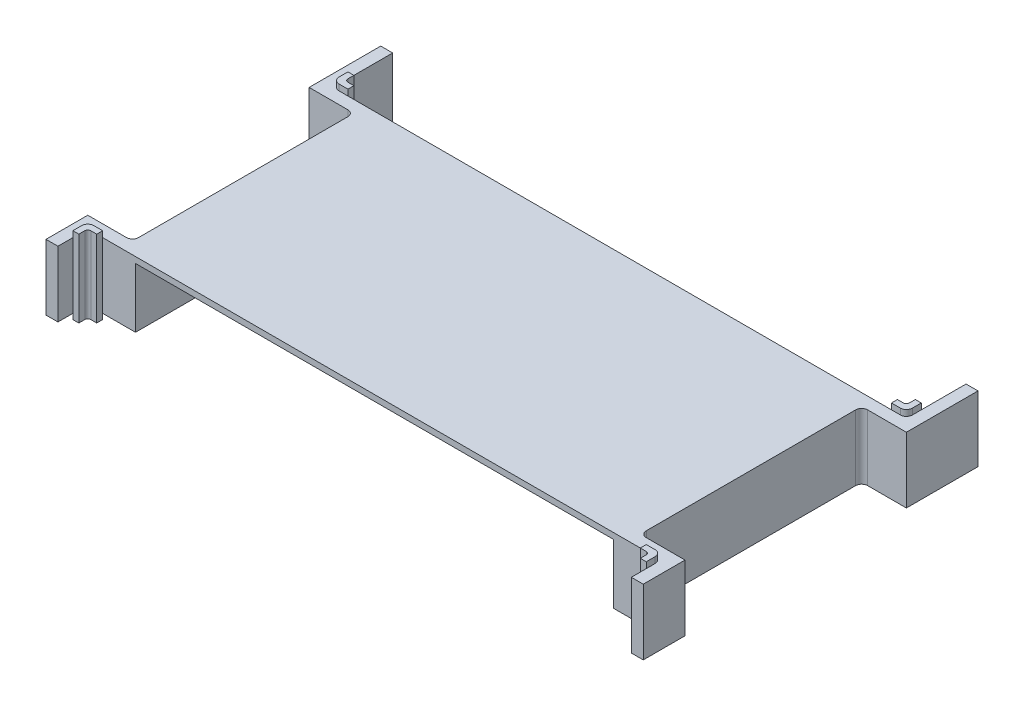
ISO-10303-21;
HEADER;
FILE_DESCRIPTION(('STEP AP214'),'2;1');
FILE_NAME('part.step','',(''),(''),'','','');
FILE_SCHEMA(('AUTOMOTIVE_DESIGN { 1 0 10303 214 1 1 1 1 }'));
ENDSEC;
DATA;
#1=APPLICATION_CONTEXT('core data for automotive mechanical design processes');
#2=APPLICATION_PROTOCOL_DEFINITION('international standard','automotive_design',2000,#1);
#3=PRODUCT_CONTEXT('',#1,'mechanical');
#4=PRODUCT('Part','Part','',(#3));
#5=PRODUCT_RELATED_PRODUCT_CATEGORY('part','',(#4));
#6=PRODUCT_DEFINITION_FORMATION('','',#4);
#7=PRODUCT_DEFINITION_CONTEXT('part definition',#1,'design');
#8=PRODUCT_DEFINITION('design','',#6,#7);
#9=PRODUCT_DEFINITION_SHAPE('','',#8);
#10=(LENGTH_UNIT() NAMED_UNIT(*) SI_UNIT(.MILLI.,.METRE.));
#11=(NAMED_UNIT(*) PLANE_ANGLE_UNIT() SI_UNIT($,.RADIAN.));
#12=(NAMED_UNIT(*) SI_UNIT($,.STERADIAN.) SOLID_ANGLE_UNIT());
#13=UNCERTAINTY_MEASURE_WITH_UNIT(LENGTH_MEASURE(1.E-05),#10,'distance_accuracy_value','');
#14=(GEOMETRIC_REPRESENTATION_CONTEXT(3) GLOBAL_UNCERTAINTY_ASSIGNED_CONTEXT((#13)) GLOBAL_UNIT_ASSIGNED_CONTEXT((#10,
#11,#12)) REPRESENTATION_CONTEXT('',''));
#15=CARTESIAN_POINT('',(0.,0.,0.));
#16=DIRECTION('',(0.,0.,1.));
#17=DIRECTION('',(1.,0.,0.));
#18=AXIS2_PLACEMENT_3D('',#15,#16,#17);
#19=CARTESIAN_POINT('',(0.,-11.,-5.));
#20=DIRECTION('',(0.,0.,1.));
#21=DIRECTION('',(1.,0.,0.));
#22=AXIS2_PLACEMENT_3D('',#19,#20,#21);
#23=PLANE('',#22);
#24=DIRECTION('',(1.,0.,0.));
#25=VECTOR('',#24,1.);
#26=CARTESIAN_POINT('',(0.,0.,-5.));
#27=LINE('',#26,#25);
#28=CARTESIAN_POINT('',(4.5,0.,-5.));
#29=VERTEX_POINT('',#28);
#30=CARTESIAN_POINT('',(95.6,0.,-5.));
#31=VERTEX_POINT('',#30);
#32=EDGE_CURVE('E988',#29,#31,#27,.T.);
#33=ORIENTED_EDGE('',*,*,#32,.F.);
#34=DIRECTION('',(0.,-1.,0.));
#35=VECTOR('',#34,1.);
#36=CARTESIAN_POINT('',(4.5,1.,-5.));
#37=LINE('',#36,#35);
#38=CARTESIAN_POINT('',(4.5,-11.,-5.));
#39=VERTEX_POINT('',#38);
#40=EDGE_CURVE('E710',#29,#39,#37,.T.);
#41=ORIENTED_EDGE('',*,*,#40,.T.);
#42=DIRECTION('',(1.,0.,0.));
#43=VECTOR('',#42,1.);
#44=CARTESIAN_POINT('',(0.,-11.,-5.));
#45=LINE('',#44,#43);
#46=CARTESIAN_POINT('',(10.,-11.,-5.));
#47=VERTEX_POINT('',#46);
#48=EDGE_CURVE('E791',#39,#47,#45,.T.);
#49=ORIENTED_EDGE('',*,*,#48,.T.);
#50=DIRECTION('',(0.,1.,0.));
#51=VECTOR('',#50,1.);
#52=CARTESIAN_POINT('',(10.,-11.,-5.));
#53=LINE('',#52,#51);
#54=CARTESIAN_POINT('',(10.,-1.,-5.));
#55=VERTEX_POINT('',#54);
#56=EDGE_CURVE('E837',#47,#55,#53,.T.);
#57=ORIENTED_EDGE('',*,*,#56,.T.);
#58=DIRECTION('',(1.,0.,0.));
#59=VECTOR('',#58,1.);
#60=CARTESIAN_POINT('',(0.,-1.,-5.));
#61=LINE('',#60,#59);
#62=CARTESIAN_POINT('',(90.1,-1.,-5.));
#63=VERTEX_POINT('',#62);
#64=EDGE_CURVE('E907',#55,#63,#61,.T.);
#65=ORIENTED_EDGE('',*,*,#64,.T.);
#66=DIRECTION('',(0.,1.,0.));
#67=VECTOR('',#66,1.);
#68=CARTESIAN_POINT('',(90.1,-11.,-5.));
#69=LINE('',#68,#67);
#70=CARTESIAN_POINT('',(90.1,-11.,-5.));
#71=VERTEX_POINT('',#70);
#72=EDGE_CURVE('E1013',#71,#63,#69,.T.);
#73=ORIENTED_EDGE('',*,*,#72,.F.);
#74=DIRECTION('',(1.,0.,0.));
#75=VECTOR('',#74,1.);
#76=CARTESIAN_POINT('',(0.,-11.,-5.));
#77=LINE('',#76,#75);
#78=CARTESIAN_POINT('',(95.6,-11.,-5.));
#79=VERTEX_POINT('',#78);
#80=EDGE_CURVE('E938',#71,#79,#77,.T.);
#81=ORIENTED_EDGE('',*,*,#80,.T.);
#82=DIRECTION('',(0.,1.,0.));
#83=VECTOR('',#82,1.);
#84=CARTESIAN_POINT('',(95.6,-11.9,-5.));
#85=LINE('',#84,#83);
#86=EDGE_CURVE('E767',#79,#31,#85,.T.);
#87=ORIENTED_EDGE('',*,*,#86,.T.);
#88=EDGE_LOOP('',(#33,#41,#49,#57,#65,#73,#81,#87));
#89=FACE_BOUND('',#88,.T.);
#90=ADVANCED_FACE('F35',(#89),#23,.T.);
#91=CARTESIAN_POINT('',(2.,-11.,0.));
#92=DIRECTION('',(1.,0.,0.));
#93=DIRECTION('',(0.,0.,-1.));
#94=AXIS2_PLACEMENT_3D('',#91,#92,#93);
#95=PLANE('',#94);
#96=DIRECTION('',(0.,0.,-1.));
#97=VECTOR('',#96,1.);
#98=CARTESIAN_POINT('',(2.,-11.,0.));
#99=LINE('',#98,#97);
#100=CARTESIAN_POINT('',(2.,-11.,0.));
#101=VERTEX_POINT('',#100);
#102=CARTESIAN_POINT('',(2.,-11.,-2.5));
#103=VERTEX_POINT('',#102);
#104=EDGE_CURVE('E834',#101,#103,#99,.T.);
#105=ORIENTED_EDGE('',*,*,#104,.T.);
#106=DIRECTION('',(0.,-1.,0.));
#107=VECTOR('',#106,1.);
#108=CARTESIAN_POINT('',(2.,1.,-2.5));
#109=LINE('',#108,#107);
#110=CARTESIAN_POINT('',(2.,0.,-2.5));
#111=VERTEX_POINT('',#110);
#112=EDGE_CURVE('E697',#111,#103,#109,.T.);
#113=ORIENTED_EDGE('',*,*,#112,.F.);
#114=DIRECTION('',(0.,0.,-1.));
#115=VECTOR('',#114,1.);
#116=CARTESIAN_POINT('',(2.,0.,0.));
#117=LINE('',#116,#115);
#118=CARTESIAN_POINT('',(2.,0.,0.));
#119=VERTEX_POINT('',#118);
#120=EDGE_CURVE('E792',#119,#111,#117,.T.);
#121=ORIENTED_EDGE('',*,*,#120,.F.);
#122=DIRECTION('',(0.,1.,0.));
#123=VECTOR('',#122,1.);
#124=CARTESIAN_POINT('',(2.,-11.,0.));
#125=LINE('',#124,#123);
#126=EDGE_CURVE('E872',#101,#119,#125,.T.);
#127=ORIENTED_EDGE('',*,*,#126,.F.);
#128=EDGE_LOOP('',(#105,#113,#121,#127));
#129=FACE_BOUND('',#128,.T.);
#130=ADVANCED_FACE('F1158',(#129),#95,.T.);
#131=CARTESIAN_POINT('',(98.1,-11.,0.));
#132=DIRECTION('',(-1.,0.,0.));
#133=DIRECTION('',(0.,0.,1.));
#134=AXIS2_PLACEMENT_3D('',#131,#132,#133);
#135=PLANE('',#134);
#136=DIRECTION('',(0.,0.,1.));
#137=VECTOR('',#136,1.);
#138=CARTESIAN_POINT('',(98.1,0.,0.));
#139=LINE('',#138,#137);
#140=CARTESIAN_POINT('',(98.1,0.,-2.50000000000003));
#141=VERTEX_POINT('',#140);
#142=CARTESIAN_POINT('',(98.1,0.,0.));
#143=VERTEX_POINT('',#142);
#144=EDGE_CURVE('E990',#141,#143,#139,.T.);
#145=ORIENTED_EDGE('',*,*,#144,.F.);
#146=DIRECTION('',(0.,1.,0.));
#147=VECTOR('',#146,1.);
#148=CARTESIAN_POINT('',(98.1,-11.9,-2.50000000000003));
#149=LINE('',#148,#147);
#150=CARTESIAN_POINT('',(98.1,-11.,-2.50000000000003));
#151=VERTEX_POINT('',#150);
#152=EDGE_CURVE('E780',#151,#141,#149,.T.);
#153=ORIENTED_EDGE('',*,*,#152,.F.);
#154=DIRECTION('',(0.,0.,1.));
#155=VECTOR('',#154,1.);
#156=CARTESIAN_POINT('',(98.1,-11.,0.));
#157=LINE('',#156,#155);
#158=CARTESIAN_POINT('',(98.1,-11.,0.));
#159=VERTEX_POINT('',#158);
#160=EDGE_CURVE('E944',#151,#159,#157,.T.);
#161=ORIENTED_EDGE('',*,*,#160,.T.);
#162=DIRECTION('',(0.,1.,0.));
#163=VECTOR('',#162,1.);
#164=CARTESIAN_POINT('',(98.1,-11.,0.));
#165=LINE('',#164,#163);
#166=EDGE_CURVE('E1010',#159,#143,#165,.T.);
#167=ORIENTED_EDGE('',*,*,#166,.T.);
#168=EDGE_LOOP('',(#145,#153,#161,#167));
#169=FACE_BOUND('',#168,.T.);
#170=ADVANCED_FACE('F1231',(#169),#135,.T.);
#171=CARTESIAN_POINT('',(92.6,-11.,0.));
#172=DIRECTION('',(1.,0.,0.));
#173=DIRECTION('',(0.,0.,-1.));
#174=AXIS2_PLACEMENT_3D('',#171,#172,#173);
#175=PLANE('',#174);
#176=DIRECTION('',(0.,0.,-1.));
#177=VECTOR('',#176,1.);
#178=CARTESIAN_POINT('',(92.6,0.,0.));
#179=LINE('',#178,#177);
#180=CARTESIAN_POINT('',(92.6,0.,-8.00000000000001));
#181=VERTEX_POINT('',#180);
#182=CARTESIAN_POINT('',(92.6,0.,-43.1));
#183=VERTEX_POINT('',#182);
#184=EDGE_CURVE('E910',#181,#183,#179,.T.);
#185=ORIENTED_EDGE('',*,*,#184,.F.);
#186=DIRECTION('',(0.,1.,0.));
#187=VECTOR('',#186,1.);
#188=CARTESIAN_POINT('',(92.6,-11.,-8.00000000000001));
#189=LINE('',#188,#187);
#190=CARTESIAN_POINT('',(92.6,-11.,-8.00000000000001));
#191=VERTEX_POINT('',#190);
#192=EDGE_CURVE('E11',#191,#181,#189,.T.);
#193=ORIENTED_EDGE('',*,*,#192,.F.);
#194=DIRECTION('',(0.,0.,-1.));
#195=VECTOR('',#194,1.);
#196=CARTESIAN_POINT('',(92.6,-11.,0.));
#197=LINE('',#196,#195);
#198=CARTESIAN_POINT('',(92.6,-11.,-43.1));
#199=VERTEX_POINT('',#198);
#200=EDGE_CURVE('E911',#191,#199,#197,.T.);
#201=ORIENTED_EDGE('',*,*,#200,.T.);
#202=DIRECTION('',(0.,1.,0.));
#203=VECTOR('',#202,1.);
#204=CARTESIAN_POINT('',(92.6,-11.,-43.1));
#205=LINE('',#204,#203);
#206=EDGE_CURVE('E39',#199,#183,#205,.T.);
#207=ORIENTED_EDGE('',*,*,#206,.T.);
#208=EDGE_LOOP('',(#185,#193,#201,#207));
#209=FACE_BOUND('',#208,.T.);
#210=ADVANCED_FACE('F37',(#209),#175,.T.);
#211=CARTESIAN_POINT('',(93.6,-11.,-8.));
#212=DIRECTION('',(0.,1.,0.));
#213=DIRECTION('',(0.,0.,1.));
#214=AXIS2_PLACEMENT_3D('',#211,#212,#213);
#215=CYLINDRICAL_SURFACE('',#214,1.);
#216=CARTESIAN_POINT('',(93.6,0.,-8.));
#217=DIRECTION('',(0.,1.,0.));
#218=DIRECTION('',(0.,0.,1.));
#219=AXIS2_PLACEMENT_3D('',#216,#217,#218);
#220=CIRCLE('',#219,1.);
#221=CARTESIAN_POINT('',(93.6,0.,-7.));
#222=VERTEX_POINT('',#221);
#223=EDGE_CURVE('E915',#181,#222,#220,.T.);
#224=ORIENTED_EDGE('',*,*,#223,.T.);
#225=DIRECTION('',(0.,1.,0.));
#226=VECTOR('',#225,1.);
#227=CARTESIAN_POINT('',(93.6,-11.,-7.));
#228=LINE('',#227,#226);
#229=CARTESIAN_POINT('',(93.6,-11.,-7.));
#230=VERTEX_POINT('',#229);
#231=EDGE_CURVE('E44',#230,#222,#228,.T.);
#232=ORIENTED_EDGE('',*,*,#231,.F.);
#233=CARTESIAN_POINT('',(93.6,-11.,-8.));
#234=DIRECTION('',(0.,1.,0.));
#235=DIRECTION('',(0.,0.,1.));
#236=AXIS2_PLACEMENT_3D('',#233,#234,#235);
#237=CIRCLE('',#236,1.);
#238=EDGE_CURVE('E956',#191,#230,#237,.T.);
#239=ORIENTED_EDGE('',*,*,#238,.F.);
#240=ORIENTED_EDGE('',*,*,#192,.T.);
#241=EDGE_LOOP('',(#224,#232,#239,#240));
#242=FACE_BOUND('',#241,.T.);
#243=ADVANCED_FACE('F1038',(#242),#215,.F.);
#244=CARTESIAN_POINT('',(0.,-11.,-7.));
#245=DIRECTION('',(0.,0.,-1.));
#246=DIRECTION('',(-1.,0.,0.));
#247=AXIS2_PLACEMENT_3D('',#244,#245,#246);
#248=PLANE('',#247);
#249=DIRECTION('',(-1.,0.,0.));
#250=VECTOR('',#249,1.);
#251=CARTESIAN_POINT('',(0.,0.,-7.));
#252=LINE('',#251,#250);
#253=CARTESIAN_POINT('',(100.1,0.,-7.));
#254=VERTEX_POINT('',#253);
#255=EDGE_CURVE('E1000',#254,#222,#252,.T.);
#256=ORIENTED_EDGE('',*,*,#255,.F.);
#257=DIRECTION('',(0.,1.,0.));
#258=VECTOR('',#257,1.);
#259=CARTESIAN_POINT('',(100.1,-11.,-7.));
#260=LINE('',#259,#258);
#261=CARTESIAN_POINT('',(100.1,-11.,-7.));
#262=VERTEX_POINT('',#261);
#263=EDGE_CURVE('E1006',#262,#254,#260,.T.);
#264=ORIENTED_EDGE('',*,*,#263,.F.);
#265=DIRECTION('',(-1.,0.,0.));
#266=VECTOR('',#265,1.);
#267=CARTESIAN_POINT('',(0.,-11.,-7.));
#268=LINE('',#267,#266);
#269=EDGE_CURVE('E953',#262,#230,#268,.T.);
#270=ORIENTED_EDGE('',*,*,#269,.T.);
#271=ORIENTED_EDGE('',*,*,#231,.T.);
#272=EDGE_LOOP('',(#256,#264,#270,#271));
#273=FACE_BOUND('',#272,.T.);
#274=ADVANCED_FACE('F1266',(#273),#248,.T.);
#275=CARTESIAN_POINT('',(100.1,-11.,0.));
#276=DIRECTION('',(1.,0.,0.));
#277=DIRECTION('',(0.,0.,-1.));
#278=AXIS2_PLACEMENT_3D('',#275,#276,#277);
#279=PLANE('',#278);
#280=DIRECTION('',(0.,0.,-1.));
#281=VECTOR('',#280,1.);
#282=CARTESIAN_POINT('',(100.1,0.,0.));
#283=LINE('',#282,#281);
#284=CARTESIAN_POINT('',(100.1,0.,0.));
#285=VERTEX_POINT('',#284);
#286=EDGE_CURVE('E997',#285,#254,#283,.T.);
#287=ORIENTED_EDGE('',*,*,#286,.F.);
#288=DIRECTION('',(0.,1.,0.));
#289=VECTOR('',#288,1.);
#290=CARTESIAN_POINT('',(100.1,-11.,0.));
#291=LINE('',#290,#289);
#292=CARTESIAN_POINT('',(100.1,-11.,0.));
#293=VERTEX_POINT('',#292);
#294=EDGE_CURVE('E1008',#293,#285,#291,.T.);
#295=ORIENTED_EDGE('',*,*,#294,.F.);
#296=DIRECTION('',(0.,0.,-1.));
#297=VECTOR('',#296,1.);
#298=CARTESIAN_POINT('',(100.1,-11.,0.));
#299=LINE('',#298,#297);
#300=EDGE_CURVE('E950',#293,#262,#299,.T.);
#301=ORIENTED_EDGE('',*,*,#300,.T.);
#302=ORIENTED_EDGE('',*,*,#263,.T.);
#303=EDGE_LOOP('',(#287,#295,#301,#302));
#304=FACE_BOUND('',#303,.T.);
#305=ADVANCED_FACE('F1269',(#304),#279,.T.);
#306=CARTESIAN_POINT('',(0.,-11.,0.));
#307=DIRECTION('',(0.,0.,1.));
#308=DIRECTION('',(1.,0.,0.));
#309=AXIS2_PLACEMENT_3D('',#306,#307,#308);
#310=PLANE('',#309);
#311=DIRECTION('',(1.,0.,0.));
#312=VECTOR('',#311,1.);
#313=CARTESIAN_POINT('',(0.,0.,0.));
#314=LINE('',#313,#312);
#315=EDGE_CURVE('E994',#143,#285,#314,.T.);
#316=ORIENTED_EDGE('',*,*,#315,.F.);
#317=ORIENTED_EDGE('',*,*,#166,.F.);
#318=DIRECTION('',(1.,0.,0.));
#319=VECTOR('',#318,1.);
#320=CARTESIAN_POINT('',(0.,-11.,0.));
#321=LINE('',#320,#319);
#322=EDGE_CURVE('E947',#159,#293,#321,.T.);
#323=ORIENTED_EDGE('',*,*,#322,.T.);
#324=ORIENTED_EDGE('',*,*,#294,.T.);
#325=EDGE_LOOP('',(#316,#317,#323,#324));
#326=FACE_BOUND('',#325,.T.);
#327=ADVANCED_FACE('F1240',(#326),#310,.T.);
#328=CARTESIAN_POINT('',(90.1,-11.,0.));
#329=DIRECTION('',(-1.,0.,0.));
#330=DIRECTION('',(0.,0.,1.));
#331=AXIS2_PLACEMENT_3D('',#328,#329,#330);
#332=PLANE('',#331);
#333=DIRECTION('',(0.,0.,1.));
#334=VECTOR('',#333,1.);
#335=CARTESIAN_POINT('',(90.1,-1.,0.));
#336=LINE('',#335,#334);
#337=CARTESIAN_POINT('',(90.1,-1.,-46.1));
#338=VERTEX_POINT('',#337);
#339=EDGE_CURVE('E874',#338,#63,#336,.T.);
#340=ORIENTED_EDGE('',*,*,#339,.F.);
#341=DIRECTION('',(0.,1.,0.));
#342=VECTOR('',#341,1.);
#343=CARTESIAN_POINT('',(90.1,-11.,-46.1));
#344=LINE('',#343,#342);
#345=CARTESIAN_POINT('',(90.1,-11.,-46.1));
#346=VERTEX_POINT('',#345);
#347=EDGE_CURVE('E1015',#346,#338,#344,.T.);
#348=ORIENTED_EDGE('',*,*,#347,.F.);
#349=DIRECTION('',(0.,0.,1.));
#350=VECTOR('',#349,1.);
#351=CARTESIAN_POINT('',(90.1,-11.,0.));
#352=LINE('',#351,#350);
#353=EDGE_CURVE('E935',#346,#71,#352,.T.);
#354=ORIENTED_EDGE('',*,*,#353,.T.);
#355=ORIENTED_EDGE('',*,*,#72,.T.);
#356=EDGE_LOOP('',(#340,#348,#354,#355));
#357=FACE_BOUND('',#356,.T.);
#358=ADVANCED_FACE('F1236',(#357),#332,.T.);
#359=CARTESIAN_POINT('',(0.,-11.,-46.1));
#360=DIRECTION('',(0.,0.,-1.));
#361=DIRECTION('',(-1.,0.,0.));
#362=AXIS2_PLACEMENT_3D('',#359,#360,#361);
#363=PLANE('',#362);
#364=DIRECTION('',(0.,-1.,0.));
#365=VECTOR('',#364,1.);
#366=CARTESIAN_POINT('',(4.5,1.,-46.1));
#367=LINE('',#366,#365);
#368=CARTESIAN_POINT('',(4.5,0.,-46.1));
#369=VERTEX_POINT('',#368);
#370=CARTESIAN_POINT('',(4.5,-11.,-46.1));
#371=VERTEX_POINT('',#370);
#372=EDGE_CURVE('E52',#369,#371,#367,.T.);
#373=ORIENTED_EDGE('',*,*,#372,.F.);
#374=DIRECTION('',(-1.,0.,0.));
#375=VECTOR('',#374,1.);
#376=CARTESIAN_POINT('',(0.,0.,-46.1));
#377=LINE('',#376,#375);
#378=CARTESIAN_POINT('',(95.6,0.,-46.1));
#379=VERTEX_POINT('',#378);
#380=EDGE_CURVE('E979',#379,#369,#377,.T.);
#381=ORIENTED_EDGE('',*,*,#380,.F.);
#382=DIRECTION('',(0.,1.,0.));
#383=VECTOR('',#382,1.);
#384=CARTESIAN_POINT('',(95.6,-11.9,-46.1));
#385=LINE('',#384,#383);
#386=CARTESIAN_POINT('',(95.6,-11.,-46.1));
#387=VERTEX_POINT('',#386);
#388=EDGE_CURVE('E639',#387,#379,#385,.T.);
#389=ORIENTED_EDGE('',*,*,#388,.F.);
#390=DIRECTION('',(-1.,0.,0.));
#391=VECTOR('',#390,1.);
#392=CARTESIAN_POINT('',(0.,-11.,-46.1));
#393=LINE('',#392,#391);
#394=EDGE_CURVE('E932',#387,#346,#393,.T.);
#395=ORIENTED_EDGE('',*,*,#394,.T.);
#396=ORIENTED_EDGE('',*,*,#347,.T.);
#397=DIRECTION('',(-1.,0.,0.));
#398=VECTOR('',#397,1.);
#399=CARTESIAN_POINT('',(0.,-1.,-46.1));
#400=LINE('',#399,#398);
#401=CARTESIAN_POINT('',(10.,-1.,-46.1));
#402=VERTEX_POINT('',#401);
#403=EDGE_CURVE('E901',#338,#402,#400,.T.);
#404=ORIENTED_EDGE('',*,*,#403,.T.);
#405=DIRECTION('',(0.,1.,0.));
#406=VECTOR('',#405,1.);
#407=CARTESIAN_POINT('',(10.,-11.,-46.1));
#408=LINE('',#407,#406);
#409=CARTESIAN_POINT('',(10.,-11.,-46.1));
#410=VERTEX_POINT('',#409);
#411=EDGE_CURVE('E894',#410,#402,#408,.T.);
#412=ORIENTED_EDGE('',*,*,#411,.F.);
#413=DIRECTION('',(-1.,0.,0.));
#414=VECTOR('',#413,1.);
#415=CARTESIAN_POINT('',(0.,-11.,-46.1));
#416=LINE('',#415,#414);
#417=EDGE_CURVE('E800',#410,#371,#416,.T.);
#418=ORIENTED_EDGE('',*,*,#417,.T.);
#419=EDGE_LOOP('',(#373,#381,#389,#395,#396,#404,#412,#418));
#420=FACE_BOUND('',#419,.T.);
#421=ADVANCED_FACE('F1239',(#420),#363,.T.);
#422=CARTESIAN_POINT('',(98.1000000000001,-11.,-1.51267887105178E-13));
#423=DIRECTION('',(-1.,0.,0.));
#424=DIRECTION('',(0.,0.,1.));
#425=AXIS2_PLACEMENT_3D('',#422,#423,#424);
#426=PLANE('',#425);
#427=DIRECTION('',(0.,1.,0.));
#428=VECTOR('',#427,1.);
#429=CARTESIAN_POINT('',(98.1,-11.9,-48.6));
#430=LINE('',#429,#428);
#431=CARTESIAN_POINT('',(98.1,-11.,-48.6));
#432=VERTEX_POINT('',#431);
#433=CARTESIAN_POINT('',(98.1,0.,-48.6));
#434=VERTEX_POINT('',#433);
#435=EDGE_CURVE('E626',#432,#434,#430,.T.);
#436=ORIENTED_EDGE('',*,*,#435,.T.);
#437=DIRECTION('',(0.,0.,1.));
#438=VECTOR('',#437,1.);
#439=CARTESIAN_POINT('',(98.1000000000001,0.,-1.51267887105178E-13));
#440=LINE('',#439,#438);
#441=CARTESIAN_POINT('',(98.1,0.,-56.1));
#442=VERTEX_POINT('',#441);
#443=EDGE_CURVE('E973',#442,#434,#440,.T.);
#444=ORIENTED_EDGE('',*,*,#443,.F.);
#445=DIRECTION('',(0.,1.,0.));
#446=VECTOR('',#445,1.);
#447=CARTESIAN_POINT('',(98.1,-11.,-56.1));
#448=LINE('',#447,#446);
#449=CARTESIAN_POINT('',(98.1,-11.,-56.1));
#450=VERTEX_POINT('',#449);
#451=EDGE_CURVE('E1018',#450,#442,#448,.T.);
#452=ORIENTED_EDGE('',*,*,#451,.F.);
#453=DIRECTION('',(0.,0.,1.));
#454=VECTOR('',#453,1.);
#455=CARTESIAN_POINT('',(98.1000000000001,-11.,-1.51267887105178E-13));
#456=LINE('',#455,#454);
#457=EDGE_CURVE('E927',#450,#432,#456,.T.);
#458=ORIENTED_EDGE('',*,*,#457,.T.);
#459=EDGE_LOOP('',(#436,#444,#452,#458));
#460=FACE_BOUND('',#459,.T.);
#461=ADVANCED_FACE('F1058',(#460),#426,.T.);
#462=CARTESIAN_POINT('',(0.,-11.,-56.1));
#463=DIRECTION('',(0.,0.,-1.));
#464=DIRECTION('',(-1.,0.,0.));
#465=AXIS2_PLACEMENT_3D('',#462,#463,#464);
#466=PLANE('',#465);
#467=DIRECTION('',(-1.,0.,0.));
#468=VECTOR('',#467,1.);
#469=CARTESIAN_POINT('',(0.,0.,-56.1));
#470=LINE('',#469,#468);
#471=CARTESIAN_POINT('',(100.1,0.,-56.1));
#472=VERTEX_POINT('',#471);
#473=EDGE_CURVE('E969',#472,#442,#470,.T.);
#474=ORIENTED_EDGE('',*,*,#473,.F.);
#475=DIRECTION('',(0.,1.,0.));
#476=VECTOR('',#475,1.);
#477=CARTESIAN_POINT('',(100.1,-11.,-56.1));
#478=LINE('',#477,#476);
#479=CARTESIAN_POINT('',(100.1,-11.,-56.1));
#480=VERTEX_POINT('',#479);
#481=EDGE_CURVE('E1020',#480,#472,#478,.T.);
#482=ORIENTED_EDGE('',*,*,#481,.F.);
#483=DIRECTION('',(-1.,0.,0.));
#484=VECTOR('',#483,1.);
#485=CARTESIAN_POINT('',(0.,-11.,-56.1));
#486=LINE('',#485,#484);
#487=EDGE_CURVE('E924',#480,#450,#486,.T.);
#488=ORIENTED_EDGE('',*,*,#487,.T.);
#489=ORIENTED_EDGE('',*,*,#451,.T.);
#490=EDGE_LOOP('',(#474,#482,#488,#489));
#491=FACE_BOUND('',#490,.T.);
#492=ADVANCED_FACE('F1053',(#491),#466,.T.);
#493=CARTESIAN_POINT('',(100.1,-11.,0.));
#494=DIRECTION('',(1.,0.,0.));
#495=DIRECTION('',(0.,0.,-1.));
#496=AXIS2_PLACEMENT_3D('',#493,#494,#495);
#497=PLANE('',#496);
#498=DIRECTION('',(0.,0.,-1.));
#499=VECTOR('',#498,1.);
#500=CARTESIAN_POINT('',(100.1,0.,0.));
#501=LINE('',#500,#499);
#502=CARTESIAN_POINT('',(100.1,0.,-44.1));
#503=VERTEX_POINT('',#502);
#504=EDGE_CURVE('E966',#503,#472,#501,.T.);
#505=ORIENTED_EDGE('',*,*,#504,.F.);
#506=DIRECTION('',(0.,1.,0.));
#507=VECTOR('',#506,1.);
#508=CARTESIAN_POINT('',(100.1,-11.,-44.1));
#509=LINE('',#508,#507);
#510=CARTESIAN_POINT('',(100.1,-11.,-44.1));
#511=VERTEX_POINT('',#510);
#512=EDGE_CURVE('E1022',#511,#503,#509,.T.);
#513=ORIENTED_EDGE('',*,*,#512,.F.);
#514=DIRECTION('',(0.,0.,-1.));
#515=VECTOR('',#514,1.);
#516=CARTESIAN_POINT('',(100.1,-11.,0.));
#517=LINE('',#516,#515);
#518=EDGE_CURVE('E921',#511,#480,#517,.T.);
#519=ORIENTED_EDGE('',*,*,#518,.T.);
#520=ORIENTED_EDGE('',*,*,#481,.T.);
#521=EDGE_LOOP('',(#505,#513,#519,#520));
#522=FACE_BOUND('',#521,.T.);
#523=ADVANCED_FACE('F1051',(#522),#497,.T.);
#524=CARTESIAN_POINT('',(0.,-11.,-44.1));
#525=DIRECTION('',(0.,0.,1.));
#526=DIRECTION('',(1.,0.,0.));
#527=AXIS2_PLACEMENT_3D('',#524,#525,#526);
#528=PLANE('',#527);
#529=DIRECTION('',(1.,0.,0.));
#530=VECTOR('',#529,1.);
#531=CARTESIAN_POINT('',(0.,0.,-44.1));
#532=LINE('',#531,#530);
#533=CARTESIAN_POINT('',(93.6,0.,-44.1));
#534=VERTEX_POINT('',#533);
#535=EDGE_CURVE('E963',#534,#503,#532,.T.);
#536=ORIENTED_EDGE('',*,*,#535,.F.);
#537=DIRECTION('',(0.,1.,0.));
#538=VECTOR('',#537,1.);
#539=CARTESIAN_POINT('',(93.6,-11.,-44.1));
#540=LINE('',#539,#538);
#541=CARTESIAN_POINT('',(93.6,-11.,-44.1));
#542=VERTEX_POINT('',#541);
#543=EDGE_CURVE('E1023',#542,#534,#540,.T.);
#544=ORIENTED_EDGE('',*,*,#543,.F.);
#545=DIRECTION('',(1.,0.,0.));
#546=VECTOR('',#545,1.);
#547=CARTESIAN_POINT('',(0.,-11.,-44.1));
#548=LINE('',#547,#546);
#549=EDGE_CURVE('E918',#542,#511,#548,.T.);
#550=ORIENTED_EDGE('',*,*,#549,.T.);
#551=ORIENTED_EDGE('',*,*,#512,.T.);
#552=EDGE_LOOP('',(#536,#544,#550,#551));
#553=FACE_BOUND('',#552,.T.);
#554=ADVANCED_FACE('F1047',(#553),#528,.T.);
#555=CARTESIAN_POINT('',(93.6,-11.,-43.1));
#556=DIRECTION('',(0.,1.,0.));
#557=DIRECTION('',(0.,0.,1.));
#558=AXIS2_PLACEMENT_3D('',#555,#556,#557);
#559=CYLINDRICAL_SURFACE('',#558,1.);
#560=CARTESIAN_POINT('',(93.6,0.,-43.1));
#561=DIRECTION('',(0.,1.,0.));
#562=DIRECTION('',(0.,0.,1.));
#563=AXIS2_PLACEMENT_3D('',#560,#561,#562);
#564=CIRCLE('',#563,1.);
#565=EDGE_CURVE('E960',#183,#534,#564,.F.);
#566=ORIENTED_EDGE('',*,*,#565,.F.);
#567=ORIENTED_EDGE('',*,*,#206,.F.);
#568=CARTESIAN_POINT('',(93.6,-11.,-43.1));
#569=DIRECTION('',(0.,1.,0.));
#570=DIRECTION('',(0.,0.,1.));
#571=AXIS2_PLACEMENT_3D('',#568,#569,#570);
#572=CIRCLE('',#571,1.);
#573=EDGE_CURVE('E914',#199,#542,#572,.F.);
#574=ORIENTED_EDGE('',*,*,#573,.T.);
#575=ORIENTED_EDGE('',*,*,#543,.T.);
#576=EDGE_LOOP('',(#566,#567,#574,#575));
#577=FACE_BOUND('',#576,.T.);
#578=ADVANCED_FACE('F1031',(#577),#559,.F.);
#579=CARTESIAN_POINT('',(0.,-11.,0.));
#580=DIRECTION('',(0.,1.,0.));
#581=DIRECTION('',(0.,0.,1.));
#582=AXIS2_PLACEMENT_3D('',#579,#580,#581);
#583=PLANE('',#582);
#584=ORIENTED_EDGE('',*,*,#200,.F.);
#585=ORIENTED_EDGE('',*,*,#238,.T.);
#586=ORIENTED_EDGE('',*,*,#269,.F.);
#587=ORIENTED_EDGE('',*,*,#300,.F.);
#588=ORIENTED_EDGE('',*,*,#322,.F.);
#589=ORIENTED_EDGE('',*,*,#160,.F.);
#590=CARTESIAN_POINT('',(98.1,-11.,-3.99999999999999));
#591=VERTEX_POINT('',#590);
#592=EDGE_CURVE('E945',#591,#151,#157,.T.);
#593=ORIENTED_EDGE('',*,*,#592,.F.);
#594=CARTESIAN_POINT('',(97.1,-11.,-4.));
#595=DIRECTION('',(0.,1.,0.));
#596=DIRECTION('',(0.,0.,1.));
#597=AXIS2_PLACEMENT_3D('',#594,#595,#596);
#598=CIRCLE('',#597,1.);
#599=CARTESIAN_POINT('',(97.1,-11.,-5.));
#600=VERTEX_POINT('',#599);
#601=EDGE_CURVE('E941',#591,#600,#598,.T.);
#602=ORIENTED_EDGE('',*,*,#601,.T.);
#603=DIRECTION('',(1.,0.,0.));
#604=VECTOR('',#603,1.);
#605=CARTESIAN_POINT('',(0.,-11.,-5.));
#606=LINE('',#605,#604);
#607=EDGE_CURVE('E763',#79,#600,#606,.T.);
#608=ORIENTED_EDGE('',*,*,#607,.F.);
#609=ORIENTED_EDGE('',*,*,#80,.F.);
#610=ORIENTED_EDGE('',*,*,#353,.F.);
#611=ORIENTED_EDGE('',*,*,#394,.F.);
#612=CARTESIAN_POINT('',(97.1,-11.,-46.1));
#613=VERTEX_POINT('',#612);
#614=EDGE_CURVE('E933',#613,#387,#393,.T.);
#615=ORIENTED_EDGE('',*,*,#614,.F.);
#616=CARTESIAN_POINT('',(97.1,-11.,-47.1));
#617=DIRECTION('',(0.,1.,0.));
#618=DIRECTION('',(0.,0.,1.));
#619=AXIS2_PLACEMENT_3D('',#616,#617,#618);
#620=CIRCLE('',#619,1.);
#621=CARTESIAN_POINT('',(98.1,-11.,-47.1));
#622=VERTEX_POINT('',#621);
#623=EDGE_CURVE('E930',#622,#613,#620,.F.);
#624=ORIENTED_EDGE('',*,*,#623,.F.);
#625=DIRECTION('',(0.,0.,1.));
#626=VECTOR('',#625,1.);
#627=CARTESIAN_POINT('',(98.1000000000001,-11.,-1.51267887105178E-13));
#628=LINE('',#627,#626);
#629=EDGE_CURVE('E620',#432,#622,#628,.T.);
#630=ORIENTED_EDGE('',*,*,#629,.F.);
#631=ORIENTED_EDGE('',*,*,#457,.F.);
#632=ORIENTED_EDGE('',*,*,#487,.F.);
#633=ORIENTED_EDGE('',*,*,#518,.F.);
#634=ORIENTED_EDGE('',*,*,#549,.F.);
#635=ORIENTED_EDGE('',*,*,#573,.F.);
#636=EDGE_LOOP('',(#584,#585,#586,#587,#588,#589,#593,#602,#608,#609,#610,#611,#615,#624,#630,
#631,#632,#633,#634,#635));
#637=FACE_BOUND('',#636,.T.);
#638=ADVANCED_FACE('F1042',(#637),#583,.F.);
#639=CARTESIAN_POINT('',(0.,0.,0.));
#640=DIRECTION('',(0.,1.,0.));
#641=DIRECTION('',(0.,0.,1.));
#642=AXIS2_PLACEMENT_3D('',#639,#640,#641);
#643=PLANE('',#642);
#644=ORIENTED_EDGE('',*,*,#184,.T.);
#645=ORIENTED_EDGE('',*,*,#565,.T.);
#646=ORIENTED_EDGE('',*,*,#535,.T.);
#647=ORIENTED_EDGE('',*,*,#504,.T.);
#648=ORIENTED_EDGE('',*,*,#473,.T.);
#649=ORIENTED_EDGE('',*,*,#443,.T.);
#650=CARTESIAN_POINT('',(98.1,0.,-47.1));
#651=VERTEX_POINT('',#650);
#652=EDGE_CURVE('E972',#434,#651,#440,.T.);
#653=ORIENTED_EDGE('',*,*,#652,.T.);
#654=CARTESIAN_POINT('',(97.1,0.,-47.1));
#655=DIRECTION('',(0.,1.,0.));
#656=DIRECTION('',(0.,0.,1.));
#657=AXIS2_PLACEMENT_3D('',#654,#655,#656);
#658=CIRCLE('',#657,1.);
#659=CARTESIAN_POINT('',(97.1,0.,-46.1));
#660=VERTEX_POINT('',#659);
#661=EDGE_CURVE('E976',#651,#660,#658,.F.);
#662=ORIENTED_EDGE('',*,*,#661,.T.);
#663=EDGE_CURVE('E980',#660,#379,#377,.T.);
#664=ORIENTED_EDGE('',*,*,#663,.T.);
#665=ORIENTED_EDGE('',*,*,#380,.T.);
#666=DIRECTION('',(1.,0.,0.));
#667=VECTOR('',#666,1.);
#668=CARTESIAN_POINT('',(0.,0.,-46.1));
#669=LINE('',#668,#667);
#670=CARTESIAN_POINT('',(3.00000000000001,0.,-46.1));
#671=VERTEX_POINT('',#670);
#672=EDGE_CURVE('E497',#671,#369,#669,.T.);
#673=ORIENTED_EDGE('',*,*,#672,.F.);
#674=CARTESIAN_POINT('',(3.,0.,-47.1));
#675=DIRECTION('',(0.,1.,0.));
#676=DIRECTION('',(0.,0.,1.));
#677=AXIS2_PLACEMENT_3D('',#674,#675,#676);
#678=CIRCLE('',#677,1.);
#679=CARTESIAN_POINT('',(2.,0.,-47.1));
#680=VERTEX_POINT('',#679);
#681=EDGE_CURVE('E840',#671,#680,#678,.F.);
#682=ORIENTED_EDGE('',*,*,#681,.T.);
#683=DIRECTION('',(0.,0.,-1.));
#684=VECTOR('',#683,1.);
#685=CARTESIAN_POINT('',(2.,0.,0.));
#686=LINE('',#685,#684);
#687=CARTESIAN_POINT('',(2.,0.,-48.6));
#688=VERTEX_POINT('',#687);
#689=EDGE_CURVE('E842',#680,#688,#686,.T.);
#690=ORIENTED_EDGE('',*,*,#689,.T.);
#691=CARTESIAN_POINT('',(2.,0.,-56.1));
#692=VERTEX_POINT('',#691);
#693=EDGE_CURVE('E60',#688,#692,#686,.T.);
#694=ORIENTED_EDGE('',*,*,#693,.T.);
#695=DIRECTION('',(-1.,0.,0.));
#696=VECTOR('',#695,1.);
#697=CARTESIAN_POINT('',(1.94635974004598E-13,0.,-56.1));
#698=LINE('',#697,#696);
#699=CARTESIAN_POINT('',(0.,0.,-56.1));
#700=VERTEX_POINT('',#699);
#701=EDGE_CURVE('E844',#692,#700,#698,.T.);
#702=ORIENTED_EDGE('',*,*,#701,.T.);
#703=DIRECTION('',(0.,0.,1.));
#704=VECTOR('',#703,1.);
#705=CARTESIAN_POINT('',(0.,0.,0.));
#706=LINE('',#705,#704);
#707=CARTESIAN_POINT('',(0.,0.,-44.1));
#708=VERTEX_POINT('',#707);
#709=EDGE_CURVE('E847',#700,#708,#706,.T.);
#710=ORIENTED_EDGE('',*,*,#709,.T.);
#711=DIRECTION('',(1.,0.,0.));
#712=VECTOR('',#711,1.);
#713=CARTESIAN_POINT('',(0.,0.,-44.1));
#714=LINE('',#713,#712);
#715=CARTESIAN_POINT('',(6.5,0.,-44.1));
#716=VERTEX_POINT('',#715);
#717=EDGE_CURVE('E850',#708,#716,#714,.T.);
#718=ORIENTED_EDGE('',*,*,#717,.T.);
#719=CARTESIAN_POINT('',(6.5,0.,-43.1));
#720=DIRECTION('',(0.,1.,0.));
#721=DIRECTION('',(0.,0.,1.));
#722=AXIS2_PLACEMENT_3D('',#719,#720,#721);
#723=CIRCLE('',#722,1.);
#724=CARTESIAN_POINT('',(7.5,0.,-43.1));
#725=VERTEX_POINT('',#724);
#726=EDGE_CURVE('E853',#725,#716,#723,.T.);
#727=ORIENTED_EDGE('',*,*,#726,.F.);
#728=DIRECTION('',(0.,0.,1.));
#729=VECTOR('',#728,1.);
#730=CARTESIAN_POINT('',(7.5,0.,0.));
#731=LINE('',#730,#729);
#732=CARTESIAN_POINT('',(7.5,0.,-8.00000000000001));
#733=VERTEX_POINT('',#732);
#734=EDGE_CURVE('E856',#725,#733,#731,.T.);
#735=ORIENTED_EDGE('',*,*,#734,.T.);
#736=CARTESIAN_POINT('',(6.5,0.,-8.));
#737=DIRECTION('',(0.,1.,0.));
#738=DIRECTION('',(0.,0.,1.));
#739=AXIS2_PLACEMENT_3D('',#736,#737,#738);
#740=CIRCLE('',#739,1.);
#741=CARTESIAN_POINT('',(6.49999999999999,0.,-7.));
#742=VERTEX_POINT('',#741);
#743=EDGE_CURVE('E859',#733,#742,#740,.F.);
#744=ORIENTED_EDGE('',*,*,#743,.T.);
#745=DIRECTION('',(1.,0.,0.));
#746=VECTOR('',#745,1.);
#747=CARTESIAN_POINT('',(0.,0.,-7.));
#748=LINE('',#747,#746);
#749=CARTESIAN_POINT('',(0.,0.,-7.));
#750=VERTEX_POINT('',#749);
#751=EDGE_CURVE('E862',#750,#742,#748,.T.);
#752=ORIENTED_EDGE('',*,*,#751,.F.);
#753=DIRECTION('',(0.,0.,-1.));
#754=VECTOR('',#753,1.);
#755=CARTESIAN_POINT('',(0.,0.,0.));
#756=LINE('',#755,#754);
#757=CARTESIAN_POINT('',(0.,0.,0.));
#758=VERTEX_POINT('',#757);
#759=EDGE_CURVE('E865',#758,#750,#756,.T.);
#760=ORIENTED_EDGE('',*,*,#759,.F.);
#761=DIRECTION('',(1.,0.,0.));
#762=VECTOR('',#761,1.);
#763=CARTESIAN_POINT('',(0.,0.,0.));
#764=LINE('',#763,#762);
#765=EDGE_CURVE('E867',#758,#119,#764,.T.);
#766=ORIENTED_EDGE('',*,*,#765,.T.);
#767=ORIENTED_EDGE('',*,*,#120,.T.);
#768=DIRECTION('',(0.,0.,1.));
#769=VECTOR('',#768,1.);
#770=CARTESIAN_POINT('',(2.,0.,0.));
#771=LINE('',#770,#769);
#772=CARTESIAN_POINT('',(2.,0.,-3.99999999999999));
#773=VERTEX_POINT('',#772);
#774=EDGE_CURVE('E714',#773,#111,#771,.T.);
#775=ORIENTED_EDGE('',*,*,#774,.F.);
#776=CARTESIAN_POINT('',(3.,0.,-4.));
#777=DIRECTION('',(0.,1.,0.));
#778=DIRECTION('',(0.,0.,1.));
#779=AXIS2_PLACEMENT_3D('',#776,#777,#778);
#780=CIRCLE('',#779,1.);
#781=CARTESIAN_POINT('',(3.00000000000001,0.,-5.));
#782=VERTEX_POINT('',#781);
#783=EDGE_CURVE('E788',#782,#773,#780,.T.);
#784=ORIENTED_EDGE('',*,*,#783,.F.);
#785=EDGE_CURVE('E984',#782,#29,#27,.T.);
#786=ORIENTED_EDGE('',*,*,#785,.T.);
#787=ORIENTED_EDGE('',*,*,#32,.T.);
#788=CARTESIAN_POINT('',(97.1,0.,-5.));
#789=VERTEX_POINT('',#788);
#790=EDGE_CURVE('E983',#31,#789,#27,.T.);
#791=ORIENTED_EDGE('',*,*,#790,.T.);
#792=CARTESIAN_POINT('',(97.1,0.,-4.));
#793=DIRECTION('',(0.,1.,0.));
#794=DIRECTION('',(0.,0.,1.));
#795=AXIS2_PLACEMENT_3D('',#792,#793,#794);
#796=CIRCLE('',#795,1.);
#797=CARTESIAN_POINT('',(98.1,0.,-3.99999999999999));
#798=VERTEX_POINT('',#797);
#799=EDGE_CURVE('E987',#798,#789,#796,.T.);
#800=ORIENTED_EDGE('',*,*,#799,.F.);
#801=EDGE_CURVE('E991',#798,#141,#139,.T.);
#802=ORIENTED_EDGE('',*,*,#801,.T.);
#803=ORIENTED_EDGE('',*,*,#144,.T.);
#804=ORIENTED_EDGE('',*,*,#315,.T.);
#805=ORIENTED_EDGE('',*,*,#286,.T.);
#806=ORIENTED_EDGE('',*,*,#255,.T.);
#807=ORIENTED_EDGE('',*,*,#223,.F.);
#808=EDGE_LOOP('',(#644,#645,#646,#647,#648,#649,#653,#662,#664,#665,#673,#682,#690,#694,#702,
#710,#718,#727,#735,#744,#752,#760,#766,#767,#775,#784,#786,#787,#791,#800,#802,#803,#804,#805,
#806,#807));
#809=FACE_BOUND('',#808,.T.);
#810=ADVANCED_FACE('F1034',(#809),#643,.T.);
#811=CARTESIAN_POINT('',(0.,-1.,0.));
#812=DIRECTION('',(0.,1.,0.));
#813=DIRECTION('',(0.,0.,1.));
#814=AXIS2_PLACEMENT_3D('',#811,#812,#813);
#815=PLANE('',#814);
#816=ORIENTED_EDGE('',*,*,#339,.T.);
#817=ORIENTED_EDGE('',*,*,#64,.F.);
#818=DIRECTION('',(0.,0.,1.));
#819=VECTOR('',#818,1.);
#820=CARTESIAN_POINT('',(10.,-1.,0.));
#821=LINE('',#820,#819);
#822=EDGE_CURVE('E904',#402,#55,#821,.T.);
#823=ORIENTED_EDGE('',*,*,#822,.F.);
#824=ORIENTED_EDGE('',*,*,#403,.F.);
#825=EDGE_LOOP('',(#816,#817,#823,#824));
#826=FACE_BOUND('',#825,.T.);
#827=ADVANCED_FACE('F1259',(#826),#815,.F.);
#828=CARTESIAN_POINT('',(10.,-11.,0.));
#829=DIRECTION('',(-1.,0.,0.));
#830=DIRECTION('',(0.,0.,1.));
#831=AXIS2_PLACEMENT_3D('',#828,#829,#830);
#832=PLANE('',#831);
#833=ORIENTED_EDGE('',*,*,#411,.T.);
#834=ORIENTED_EDGE('',*,*,#822,.T.);
#835=ORIENTED_EDGE('',*,*,#56,.F.);
#836=DIRECTION('',(0.,0.,1.));
#837=VECTOR('',#836,1.);
#838=CARTESIAN_POINT('',(10.,-11.,0.));
#839=LINE('',#838,#837);
#840=EDGE_CURVE('E796',#410,#47,#839,.T.);
#841=ORIENTED_EDGE('',*,*,#840,.F.);
#842=EDGE_LOOP('',(#833,#834,#835,#841));
#843=FACE_BOUND('',#842,.T.);
#844=ADVANCED_FACE('F1319',(#843),#832,.F.);
#845=CARTESIAN_POINT('',(0.,-11.,0.));
#846=DIRECTION('',(0.,0.,1.));
#847=DIRECTION('',(1.,0.,0.));
#848=AXIS2_PLACEMENT_3D('',#845,#846,#847);
#849=PLANE('',#848);
#850=ORIENTED_EDGE('',*,*,#765,.F.);
#851=DIRECTION('',(0.,1.,0.));
#852=VECTOR('',#851,1.);
#853=CARTESIAN_POINT('',(0.,-11.,0.));
#854=LINE('',#853,#852);
#855=CARTESIAN_POINT('',(0.,-11.,0.));
#856=VERTEX_POINT('',#855);
#857=EDGE_CURVE('E875',#856,#758,#854,.T.);
#858=ORIENTED_EDGE('',*,*,#857,.F.);
#859=DIRECTION('',(1.,0.,0.));
#860=VECTOR('',#859,1.);
#861=CARTESIAN_POINT('',(0.,-11.,0.));
#862=LINE('',#861,#860);
#863=EDGE_CURVE('E830',#856,#101,#862,.T.);
#864=ORIENTED_EDGE('',*,*,#863,.T.);
#865=ORIENTED_EDGE('',*,*,#126,.T.);
#866=EDGE_LOOP('',(#850,#858,#864,#865));
#867=FACE_BOUND('',#866,.T.);
#868=ADVANCED_FACE('F1154',(#867),#849,.T.);
#869=CARTESIAN_POINT('',(0.,-11.,0.));
#870=DIRECTION('',(1.,0.,0.));
#871=DIRECTION('',(0.,0.,-1.));
#872=AXIS2_PLACEMENT_3D('',#869,#870,#871);
#873=PLANE('',#872);
#874=ORIENTED_EDGE('',*,*,#759,.T.);
#875=DIRECTION('',(0.,1.,0.));
#876=VECTOR('',#875,1.);
#877=CARTESIAN_POINT('',(0.,-11.,-7.));
#878=LINE('',#877,#876);
#879=CARTESIAN_POINT('',(0.,-11.,-7.));
#880=VERTEX_POINT('',#879);
#881=EDGE_CURVE('E877',#880,#750,#878,.T.);
#882=ORIENTED_EDGE('',*,*,#881,.F.);
#883=DIRECTION('',(0.,0.,-1.));
#884=VECTOR('',#883,1.);
#885=CARTESIAN_POINT('',(0.,-11.,0.));
#886=LINE('',#885,#884);
#887=EDGE_CURVE('E828',#856,#880,#886,.T.);
#888=ORIENTED_EDGE('',*,*,#887,.F.);
#889=ORIENTED_EDGE('',*,*,#857,.T.);
#890=EDGE_LOOP('',(#874,#882,#888,#889));
#891=FACE_BOUND('',#890,.T.);
#892=ADVANCED_FACE('F1151',(#891),#873,.F.);
#893=CARTESIAN_POINT('',(0.,-11.,-7.));
#894=DIRECTION('',(0.,0.,1.));
#895=DIRECTION('',(1.,0.,0.));
#896=AXIS2_PLACEMENT_3D('',#893,#894,#895);
#897=PLANE('',#896);
#898=ORIENTED_EDGE('',*,*,#751,.T.);
#899=DIRECTION('',(0.,1.,0.));
#900=VECTOR('',#899,1.);
#901=CARTESIAN_POINT('',(6.49999999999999,-11.,-7.));
#902=LINE('',#901,#900);
#903=CARTESIAN_POINT('',(6.49999999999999,-11.,-7.));
#904=VERTEX_POINT('',#903);
#905=EDGE_CURVE('E880',#904,#742,#902,.T.);
#906=ORIENTED_EDGE('',*,*,#905,.F.);
#907=DIRECTION('',(1.,0.,0.));
#908=VECTOR('',#907,1.);
#909=CARTESIAN_POINT('',(0.,-11.,-7.));
#910=LINE('',#909,#908);
#911=EDGE_CURVE('E826',#880,#904,#910,.T.);
#912=ORIENTED_EDGE('',*,*,#911,.F.);
#913=ORIENTED_EDGE('',*,*,#881,.T.);
#914=EDGE_LOOP('',(#898,#906,#912,#913));
#915=FACE_BOUND('',#914,.T.);
#916=ADVANCED_FACE('F1146',(#915),#897,.F.);
#917=CARTESIAN_POINT('',(6.5,-11.,-8.));
#918=DIRECTION('',(0.,1.,0.));
#919=DIRECTION('',(0.,0.,1.));
#920=AXIS2_PLACEMENT_3D('',#917,#918,#919);
#921=CYLINDRICAL_SURFACE('',#920,1.);
#922=ORIENTED_EDGE('',*,*,#743,.F.);
#923=DIRECTION('',(0.,1.,0.));
#924=VECTOR('',#923,1.);
#925=CARTESIAN_POINT('',(7.5,-11.,-8.00000000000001));
#926=LINE('',#925,#924);
#927=CARTESIAN_POINT('',(7.5,-11.,-8.00000000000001));
#928=VERTEX_POINT('',#927);
#929=EDGE_CURVE('E882',#928,#733,#926,.T.);
#930=ORIENTED_EDGE('',*,*,#929,.F.);
#931=CARTESIAN_POINT('',(6.5,-11.,-8.));
#932=DIRECTION('',(0.,1.,0.));
#933=DIRECTION('',(0.,0.,1.));
#934=AXIS2_PLACEMENT_3D('',#931,#932,#933);
#935=CIRCLE('',#934,1.);
#936=EDGE_CURVE('E823',#928,#904,#935,.F.);
#937=ORIENTED_EDGE('',*,*,#936,.T.);
#938=ORIENTED_EDGE('',*,*,#905,.T.);
#939=EDGE_LOOP('',(#922,#930,#937,#938));
#940=FACE_BOUND('',#939,.T.);
#941=ADVANCED_FACE('F1140',(#940),#921,.F.);
#942=CARTESIAN_POINT('',(7.5,-11.,0.));
#943=DIRECTION('',(-1.,0.,0.));
#944=DIRECTION('',(0.,0.,1.));
#945=AXIS2_PLACEMENT_3D('',#942,#943,#944);
#946=PLANE('',#945);
#947=ORIENTED_EDGE('',*,*,#734,.F.);
#948=DIRECTION('',(0.,1.,0.));
#949=VECTOR('',#948,1.);
#950=CARTESIAN_POINT('',(7.5,-11.,-43.1));
#951=LINE('',#950,#949);
#952=CARTESIAN_POINT('',(7.5,-11.,-43.1));
#953=VERTEX_POINT('',#952);
#954=EDGE_CURVE('E884',#953,#725,#951,.T.);
#955=ORIENTED_EDGE('',*,*,#954,.F.);
#956=DIRECTION('',(0.,0.,1.));
#957=VECTOR('',#956,1.);
#958=CARTESIAN_POINT('',(7.5,-11.,0.));
#959=LINE('',#958,#957);
#960=EDGE_CURVE('E820',#953,#928,#959,.T.);
#961=ORIENTED_EDGE('',*,*,#960,.T.);
#962=ORIENTED_EDGE('',*,*,#929,.T.);
#963=EDGE_LOOP('',(#947,#955,#961,#962));
#964=FACE_BOUND('',#963,.T.);
#965=ADVANCED_FACE('F1135',(#964),#946,.T.);
#966=CARTESIAN_POINT('',(6.5,-11.,-43.1));
#967=DIRECTION('',(0.,1.,0.));
#968=DIRECTION('',(0.,0.,1.));
#969=AXIS2_PLACEMENT_3D('',#966,#967,#968);
#970=CYLINDRICAL_SURFACE('',#969,1.);
#971=ORIENTED_EDGE('',*,*,#726,.T.);
#972=DIRECTION('',(0.,1.,0.));
#973=VECTOR('',#972,1.);
#974=CARTESIAN_POINT('',(6.5,-11.,-44.1));
#975=LINE('',#974,#973);
#976=CARTESIAN_POINT('',(6.5,-11.,-44.1));
#977=VERTEX_POINT('',#976);
#978=EDGE_CURVE('E886',#977,#716,#975,.T.);
#979=ORIENTED_EDGE('',*,*,#978,.F.);
#980=CARTESIAN_POINT('',(6.5,-11.,-43.1));
#981=DIRECTION('',(0.,1.,0.));
#982=DIRECTION('',(0.,0.,1.));
#983=AXIS2_PLACEMENT_3D('',#980,#981,#982);
#984=CIRCLE('',#983,1.);
#985=EDGE_CURVE('E818',#953,#977,#984,.T.);
#986=ORIENTED_EDGE('',*,*,#985,.F.);
#987=ORIENTED_EDGE('',*,*,#954,.T.);
#988=EDGE_LOOP('',(#971,#979,#986,#987));
#989=FACE_BOUND('',#988,.T.);
#990=ADVANCED_FACE('F1132',(#989),#970,.F.);
#991=CARTESIAN_POINT('',(0.,-11.,-44.1));
#992=DIRECTION('',(0.,0.,1.));
#993=DIRECTION('',(1.,0.,0.));
#994=AXIS2_PLACEMENT_3D('',#991,#992,#993);
#995=PLANE('',#994);
#996=ORIENTED_EDGE('',*,*,#717,.F.);
#997=DIRECTION('',(0.,1.,0.));
#998=VECTOR('',#997,1.);
#999=CARTESIAN_POINT('',(0.,-11.,-44.1));
#1000=LINE('',#999,#998);
#1001=CARTESIAN_POINT('',(0.,-11.,-44.1));
#1002=VERTEX_POINT('',#1001);
#1003=EDGE_CURVE('E888',#1002,#708,#1000,.T.);
#1004=ORIENTED_EDGE('',*,*,#1003,.F.);
#1005=DIRECTION('',(1.,0.,0.));
#1006=VECTOR('',#1005,1.);
#1007=CARTESIAN_POINT('',(0.,-11.,-44.1));
#1008=LINE('',#1007,#1006);
#1009=EDGE_CURVE('E815',#1002,#977,#1008,.T.);
#1010=ORIENTED_EDGE('',*,*,#1009,.T.);
#1011=ORIENTED_EDGE('',*,*,#978,.T.);
#1012=EDGE_LOOP('',(#996,#1004,#1010,#1011));
#1013=FACE_BOUND('',#1012,.T.);
#1014=ADVANCED_FACE('F1128',(#1013),#995,.T.);
#1015=CARTESIAN_POINT('',(0.,-11.,0.));
#1016=DIRECTION('',(-1.,0.,0.));
#1017=DIRECTION('',(0.,0.,1.));
#1018=AXIS2_PLACEMENT_3D('',#1015,#1016,#1017);
#1019=PLANE('',#1018);
#1020=ORIENTED_EDGE('',*,*,#709,.F.);
#1021=DIRECTION('',(0.,1.,0.));
#1022=VECTOR('',#1021,1.);
#1023=CARTESIAN_POINT('',(0.,-11.,-56.1));
#1024=LINE('',#1023,#1022);
#1025=CARTESIAN_POINT('',(0.,-11.,-56.1));
#1026=VERTEX_POINT('',#1025);
#1027=EDGE_CURVE('E890',#1026,#700,#1024,.T.);
#1028=ORIENTED_EDGE('',*,*,#1027,.F.);
#1029=DIRECTION('',(0.,0.,1.));
#1030=VECTOR('',#1029,1.);
#1031=CARTESIAN_POINT('',(0.,-11.,0.));
#1032=LINE('',#1031,#1030);
#1033=EDGE_CURVE('E812',#1026,#1002,#1032,.T.);
#1034=ORIENTED_EDGE('',*,*,#1033,.T.);
#1035=ORIENTED_EDGE('',*,*,#1003,.T.);
#1036=EDGE_LOOP('',(#1020,#1028,#1034,#1035));
#1037=FACE_BOUND('',#1036,.T.);
#1038=ADVANCED_FACE('F1126',(#1037),#1019,.T.);
#1039=CARTESIAN_POINT('',(1.94635974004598E-13,-11.,-56.1));
#1040=DIRECTION('',(0.,0.,-1.));
#1041=DIRECTION('',(-1.,0.,0.));
#1042=AXIS2_PLACEMENT_3D('',#1039,#1040,#1041);
#1043=PLANE('',#1042);
#1044=ORIENTED_EDGE('',*,*,#701,.F.);
#1045=DIRECTION('',(0.,1.,0.));
#1046=VECTOR('',#1045,1.);
#1047=CARTESIAN_POINT('',(2.,-11.,-56.1));
#1048=LINE('',#1047,#1046);
#1049=CARTESIAN_POINT('',(2.,-11.,-56.1));
#1050=VERTEX_POINT('',#1049);
#1051=EDGE_CURVE('E892',#1050,#692,#1048,.T.);
#1052=ORIENTED_EDGE('',*,*,#1051,.F.);
#1053=DIRECTION('',(-1.,0.,0.));
#1054=VECTOR('',#1053,1.);
#1055=CARTESIAN_POINT('',(1.94635974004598E-13,-11.,-56.1));
#1056=LINE('',#1055,#1054);
#1057=EDGE_CURVE('E809',#1050,#1026,#1056,.T.);
#1058=ORIENTED_EDGE('',*,*,#1057,.T.);
#1059=ORIENTED_EDGE('',*,*,#1027,.T.);
#1060=EDGE_LOOP('',(#1044,#1052,#1058,#1059));
#1061=FACE_BOUND('',#1060,.T.);
#1062=ADVANCED_FACE('F1121',(#1061),#1043,.T.);
#1063=CARTESIAN_POINT('',(2.,-11.,0.));
#1064=DIRECTION('',(1.,0.,0.));
#1065=DIRECTION('',(0.,0.,-1.));
#1066=AXIS2_PLACEMENT_3D('',#1063,#1064,#1065);
#1067=PLANE('',#1066);
#1068=DIRECTION('',(0.,-1.,0.));
#1069=VECTOR('',#1068,1.);
#1070=CARTESIAN_POINT('',(2.,1.,-48.6));
#1071=LINE('',#1070,#1069);
#1072=CARTESIAN_POINT('',(2.,-11.,-48.6));
#1073=VERTEX_POINT('',#1072);
#1074=EDGE_CURVE('E568',#688,#1073,#1071,.T.);
#1075=ORIENTED_EDGE('',*,*,#1074,.T.);
#1076=DIRECTION('',(0.,0.,-1.));
#1077=VECTOR('',#1076,1.);
#1078=CARTESIAN_POINT('',(2.,-11.,0.));
#1079=LINE('',#1078,#1077);
#1080=EDGE_CURVE('E805',#1073,#1050,#1079,.T.);
#1081=ORIENTED_EDGE('',*,*,#1080,.T.);
#1082=ORIENTED_EDGE('',*,*,#1051,.T.);
#1083=ORIENTED_EDGE('',*,*,#693,.F.);
#1084=EDGE_LOOP('',(#1075,#1081,#1082,#1083));
#1085=FACE_BOUND('',#1084,.T.);
#1086=ADVANCED_FACE('F1112',(#1085),#1067,.T.);
#1087=CARTESIAN_POINT('',(0.,-11.,0.));
#1088=DIRECTION('',(0.,1.,0.));
#1089=DIRECTION('',(0.,0.,1.));
#1090=AXIS2_PLACEMENT_3D('',#1087,#1088,#1089);
#1091=PLANE('',#1090);
#1092=CARTESIAN_POINT('',(3.,-11.,-4.));
#1093=DIRECTION('',(0.,1.,0.));
#1094=DIRECTION('',(0.,0.,1.));
#1095=AXIS2_PLACEMENT_3D('',#1092,#1093,#1094);
#1096=CIRCLE('',#1095,1.);
#1097=CARTESIAN_POINT('',(3.00000000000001,-11.,-5.));
#1098=VERTEX_POINT('',#1097);
#1099=CARTESIAN_POINT('',(2.,-11.,-3.99999999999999));
#1100=VERTEX_POINT('',#1099);
#1101=EDGE_CURVE('E789',#1098,#1100,#1096,.T.);
#1102=ORIENTED_EDGE('',*,*,#1101,.T.);
#1103=EDGE_CURVE('E833',#103,#1100,#99,.T.);
#1104=ORIENTED_EDGE('',*,*,#1103,.F.);
#1105=ORIENTED_EDGE('',*,*,#104,.F.);
#1106=ORIENTED_EDGE('',*,*,#863,.F.);
#1107=ORIENTED_EDGE('',*,*,#887,.T.);
#1108=ORIENTED_EDGE('',*,*,#911,.T.);
#1109=ORIENTED_EDGE('',*,*,#936,.F.);
#1110=ORIENTED_EDGE('',*,*,#960,.F.);
#1111=ORIENTED_EDGE('',*,*,#985,.T.);
#1112=ORIENTED_EDGE('',*,*,#1009,.F.);
#1113=ORIENTED_EDGE('',*,*,#1033,.F.);
#1114=ORIENTED_EDGE('',*,*,#1057,.F.);
#1115=ORIENTED_EDGE('',*,*,#1080,.F.);
#1116=CARTESIAN_POINT('',(2.,-11.,-47.1));
#1117=VERTEX_POINT('',#1116);
#1118=EDGE_CURVE('E806',#1117,#1073,#1079,.T.);
#1119=ORIENTED_EDGE('',*,*,#1118,.F.);
#1120=CARTESIAN_POINT('',(3.,-11.,-47.1));
#1121=DIRECTION('',(0.,1.,0.));
#1122=DIRECTION('',(0.,0.,1.));
#1123=AXIS2_PLACEMENT_3D('',#1120,#1121,#1122);
#1124=CIRCLE('',#1123,1.);
#1125=CARTESIAN_POINT('',(3.00000000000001,-11.,-46.1));
#1126=VERTEX_POINT('',#1125);
#1127=EDGE_CURVE('E802',#1126,#1117,#1124,.F.);
#1128=ORIENTED_EDGE('',*,*,#1127,.F.);
#1129=EDGE_CURVE('E799',#371,#1126,#416,.T.);
#1130=ORIENTED_EDGE('',*,*,#1129,.F.);
#1131=ORIENTED_EDGE('',*,*,#417,.F.);
#1132=ORIENTED_EDGE('',*,*,#840,.T.);
#1133=ORIENTED_EDGE('',*,*,#48,.F.);
#1134=EDGE_CURVE('E793',#1098,#39,#45,.T.);
#1135=ORIENTED_EDGE('',*,*,#1134,.F.);
#1136=EDGE_LOOP('',(#1102,#1104,#1105,#1106,#1107,#1108,#1109,#1110,#1111,#1112,#1113,#1114,
#1115,#1119,#1128,#1130,#1131,#1132,#1133,#1135));
#1137=FACE_BOUND('',#1136,.T.);
#1138=ADVANCED_FACE('F1116',(#1137),#1091,.F.);
#1139=CARTESIAN_POINT('',(0.,-11.9,-5.));
#1140=DIRECTION('',(0.,0.,1.));
#1141=DIRECTION('',(1.,0.,0.));
#1142=AXIS2_PLACEMENT_3D('',#1139,#1140,#1141);
#1143=PLANE('',#1142);
#1144=CARTESIAN_POINT('',(95.6,-11.9,-5.));
#1145=VERTEX_POINT('',#1144);
#1146=EDGE_CURVE('E764',#1145,#79,#85,.T.);
#1147=ORIENTED_EDGE('',*,*,#1146,.T.);
#1148=ORIENTED_EDGE('',*,*,#607,.T.);
#1149=DIRECTION('',(0.,1.,0.));
#1150=VECTOR('',#1149,1.);
#1151=CARTESIAN_POINT('',(97.1,-11.9,-5.));
#1152=LINE('',#1151,#1150);
#1153=CARTESIAN_POINT('',(97.1,-11.9,-5.));
#1154=VERTEX_POINT('',#1153);
#1155=EDGE_CURVE('E769',#1154,#600,#1152,.T.);
#1156=ORIENTED_EDGE('',*,*,#1155,.F.);
#1157=DIRECTION('',(1.,0.,0.));
#1158=VECTOR('',#1157,1.);
#1159=CARTESIAN_POINT('',(0.,-11.9,-5.));
#1160=LINE('',#1159,#1158);
#1161=EDGE_CURVE('E756',#1145,#1154,#1160,.T.);
#1162=ORIENTED_EDGE('',*,*,#1161,.F.);
#1163=EDGE_LOOP('',(#1147,#1148,#1156,#1162));
#1164=FACE_BOUND('',#1163,.T.);
#1165=ADVANCED_FACE('F1309',(#1164),#1143,.F.);
#1166=CARTESIAN_POINT('',(97.1,-11.9,-4.));
#1167=DIRECTION('',(0.,1.,0.));
#1168=DIRECTION('',(0.,0.,1.));
#1169=AXIS2_PLACEMENT_3D('',#1166,#1167,#1168);
#1170=CYLINDRICAL_SURFACE('',#1169,1.);
#1171=ORIENTED_EDGE('',*,*,#601,.F.);
#1172=DIRECTION('',(0.,1.,0.));
#1173=VECTOR('',#1172,1.);
#1174=CARTESIAN_POINT('',(98.1,-11.9,-3.99999999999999));
#1175=LINE('',#1174,#1173);
#1176=CARTESIAN_POINT('',(98.1,-11.9,-3.99999999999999));
#1177=VERTEX_POINT('',#1176);
#1178=EDGE_CURVE('E773',#1177,#591,#1175,.T.);
#1179=ORIENTED_EDGE('',*,*,#1178,.F.);
#1180=CARTESIAN_POINT('',(97.1,-11.9,-4.));
#1181=DIRECTION('',(0.,1.,0.));
#1182=DIRECTION('',(0.,0.,1.));
#1183=AXIS2_PLACEMENT_3D('',#1180,#1181,#1182);
#1184=CIRCLE('',#1183,1.);
#1185=EDGE_CURVE('E753',#1177,#1154,#1184,.T.);
#1186=ORIENTED_EDGE('',*,*,#1185,.T.);
#1187=ORIENTED_EDGE('',*,*,#1155,.T.);
#1188=EDGE_LOOP('',(#1171,#1179,#1186,#1187));
#1189=FACE_BOUND('',#1188,.T.);
#1190=ADVANCED_FACE('F1307',(#1189),#1170,.T.);
#1191=CARTESIAN_POINT('',(98.1,-11.9,0.));
#1192=DIRECTION('',(-1.,0.,0.));
#1193=DIRECTION('',(0.,0.,1.));
#1194=AXIS2_PLACEMENT_3D('',#1191,#1192,#1193);
#1195=PLANE('',#1194);
#1196=ORIENTED_EDGE('',*,*,#1178,.T.);
#1197=ORIENTED_EDGE('',*,*,#592,.T.);
#1198=CARTESIAN_POINT('',(98.1,-11.9,-2.50000000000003));
#1199=VERTEX_POINT('',#1198);
#1200=EDGE_CURVE('E777',#1199,#151,#149,.T.);
#1201=ORIENTED_EDGE('',*,*,#1200,.F.);
#1202=DIRECTION('',(0.,0.,1.));
#1203=VECTOR('',#1202,1.);
#1204=CARTESIAN_POINT('',(98.1,-11.9,0.));
#1205=LINE('',#1204,#1203);
#1206=EDGE_CURVE('E751',#1177,#1199,#1205,.T.);
#1207=ORIENTED_EDGE('',*,*,#1206,.F.);
#1208=EDGE_LOOP('',(#1196,#1197,#1201,#1207));
#1209=FACE_BOUND('',#1208,.T.);
#1210=ADVANCED_FACE('F1291',(#1209),#1195,.F.);
#1211=CARTESIAN_POINT('',(0.,-11.9,-4.00000000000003));
#1212=DIRECTION('',(0.,0.,-1.));
#1213=DIRECTION('',(-1.,0.,0.));
#1214=AXIS2_PLACEMENT_3D('',#1211,#1212,#1213);
#1215=PLANE('',#1214);
#1216=DIRECTION('',(-1.,0.,0.));
#1217=VECTOR('',#1216,1.);
#1218=CARTESIAN_POINT('',(0.,1.,-4.00000000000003));
#1219=LINE('',#1218,#1217);
#1220=CARTESIAN_POINT('',(96.6,1.,-4.00000000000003));
#1221=VERTEX_POINT('',#1220);
#1222=CARTESIAN_POINT('',(95.6,1.,-4.00000000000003));
#1223=VERTEX_POINT('',#1222);
#1224=EDGE_CURVE('E717',#1221,#1223,#1219,.T.);
#1225=ORIENTED_EDGE('',*,*,#1224,.T.);
#1226=DIRECTION('',(0.,1.,0.));
#1227=VECTOR('',#1226,1.);
#1228=CARTESIAN_POINT('',(95.6,-11.9,-4.00000000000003));
#1229=LINE('',#1228,#1227);
#1230=CARTESIAN_POINT('',(95.6,-11.9,-4.00000000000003));
#1231=VERTEX_POINT('',#1230);
#1232=EDGE_CURVE('E761',#1231,#1223,#1229,.T.);
#1233=ORIENTED_EDGE('',*,*,#1232,.F.);
#1234=DIRECTION('',(-1.,0.,0.));
#1235=VECTOR('',#1234,1.);
#1236=CARTESIAN_POINT('',(0.,-11.9,-4.00000000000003));
#1237=LINE('',#1236,#1235);
#1238=CARTESIAN_POINT('',(96.6,-11.9,-4.00000000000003));
#1239=VERTEX_POINT('',#1238);
#1240=EDGE_CURVE('E741',#1239,#1231,#1237,.T.);
#1241=ORIENTED_EDGE('',*,*,#1240,.F.);
#1242=DIRECTION('',(0.,1.,0.));
#1243=VECTOR('',#1242,1.);
#1244=CARTESIAN_POINT('',(96.6,-11.9,-4.00000000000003));
#1245=LINE('',#1244,#1243);
#1246=EDGE_CURVE('E760',#1239,#1221,#1245,.T.);
#1247=ORIENTED_EDGE('',*,*,#1246,.T.);
#1248=EDGE_LOOP('',(#1225,#1233,#1241,#1247));
#1249=FACE_BOUND('',#1248,.T.);
#1250=ADVANCED_FACE('F1795',(#1249),#1215,.F.);
#1251=CARTESIAN_POINT('',(95.6,-11.9,0.));
#1252=DIRECTION('',(1.,0.,0.));
#1253=DIRECTION('',(0.,0.,-1.));
#1254=AXIS2_PLACEMENT_3D('',#1251,#1252,#1253);
#1255=PLANE('',#1254);
#1256=DIRECTION('',(0.,0.,-1.));
#1257=VECTOR('',#1256,1.);
#1258=CARTESIAN_POINT('',(95.6,1.,0.));
#1259=LINE('',#1258,#1257);
#1260=CARTESIAN_POINT('',(95.6,1.,-5.));
#1261=VERTEX_POINT('',#1260);
#1262=EDGE_CURVE('E738',#1223,#1261,#1259,.T.);
#1263=ORIENTED_EDGE('',*,*,#1262,.T.);
#1264=EDGE_CURVE('E768',#31,#1261,#85,.T.);
#1265=ORIENTED_EDGE('',*,*,#1264,.F.);
#1266=ORIENTED_EDGE('',*,*,#86,.F.);
#1267=ORIENTED_EDGE('',*,*,#1146,.F.);
#1268=DIRECTION('',(0.,0.,-1.));
#1269=VECTOR('',#1268,1.);
#1270=CARTESIAN_POINT('',(95.6,-11.9,0.));
#1271=LINE('',#1270,#1269);
#1272=EDGE_CURVE('E758',#1231,#1145,#1271,.T.);
#1273=ORIENTED_EDGE('',*,*,#1272,.F.);
#1274=ORIENTED_EDGE('',*,*,#1232,.T.);
#1275=EDGE_LOOP('',(#1263,#1265,#1266,#1267,#1273,#1274));
#1276=FACE_BOUND('',#1275,.T.);
#1277=ADVANCED_FACE('F1785',(#1276),#1255,.F.);
#1278=ORIENTED_EDGE('',*,*,#790,.F.);
#1279=ORIENTED_EDGE('',*,*,#1264,.T.);
#1280=DIRECTION('',(1.,0.,0.));
#1281=VECTOR('',#1280,1.);
#1282=CARTESIAN_POINT('',(0.,1.,-5.));
#1283=LINE('',#1282,#1281);
#1284=CARTESIAN_POINT('',(97.1,1.,-5.));
#1285=VERTEX_POINT('',#1284);
#1286=EDGE_CURVE('E735',#1261,#1285,#1283,.T.);
#1287=ORIENTED_EDGE('',*,*,#1286,.T.);
#1288=EDGE_CURVE('E772',#789,#1285,#1152,.T.);
#1289=ORIENTED_EDGE('',*,*,#1288,.F.);
#1290=EDGE_LOOP('',(#1278,#1279,#1287,#1289));
#1291=FACE_BOUND('',#1290,.T.);
#1292=ADVANCED_FACE('F1775',(#1291),#1143,.F.);
#1293=CARTESIAN_POINT('',(98.1,1.,-3.99999999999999));
#1294=VERTEX_POINT('',#1293);
#1295=EDGE_CURVE('E776',#798,#1294,#1175,.T.);
#1296=ORIENTED_EDGE('',*,*,#1295,.F.);
#1297=ORIENTED_EDGE('',*,*,#799,.T.);
#1298=ORIENTED_EDGE('',*,*,#1288,.T.);
#1299=CARTESIAN_POINT('',(97.1,1.,-4.));
#1300=DIRECTION('',(0.,1.,0.));
#1301=DIRECTION('',(0.,0.,1.));
#1302=AXIS2_PLACEMENT_3D('',#1299,#1300,#1301);
#1303=CIRCLE('',#1302,1.);
#1304=EDGE_CURVE('E732',#1294,#1285,#1303,.T.);
#1305=ORIENTED_EDGE('',*,*,#1304,.F.);
#1306=EDGE_LOOP('',(#1296,#1297,#1298,#1305));
#1307=FACE_BOUND('',#1306,.T.);
#1308=ADVANCED_FACE('F1765',(#1307),#1170,.T.);
#1309=ORIENTED_EDGE('',*,*,#801,.F.);
#1310=ORIENTED_EDGE('',*,*,#1295,.T.);
#1311=DIRECTION('',(0.,0.,1.));
#1312=VECTOR('',#1311,1.);
#1313=CARTESIAN_POINT('',(98.1,1.,0.));
#1314=LINE('',#1313,#1312);
#1315=CARTESIAN_POINT('',(98.1,1.,-2.50000000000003));
#1316=VERTEX_POINT('',#1315);
#1317=EDGE_CURVE('E729',#1294,#1316,#1314,.T.);
#1318=ORIENTED_EDGE('',*,*,#1317,.T.);
#1319=EDGE_CURVE('E781',#141,#1316,#149,.T.);
#1320=ORIENTED_EDGE('',*,*,#1319,.F.);
#1321=EDGE_LOOP('',(#1309,#1310,#1318,#1320));
#1322=FACE_BOUND('',#1321,.T.);
#1323=ADVANCED_FACE('F1756',(#1322),#1195,.F.);
#1324=CARTESIAN_POINT('',(0.,-11.9,-2.50000000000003));
#1325=DIRECTION('',(0.,0.,-1.));
#1326=DIRECTION('',(-1.,0.,0.));
#1327=AXIS2_PLACEMENT_3D('',#1324,#1325,#1326);
#1328=PLANE('',#1327);
#1329=DIRECTION('',(-1.,0.,0.));
#1330=VECTOR('',#1329,1.);
#1331=CARTESIAN_POINT('',(0.,1.,-2.50000000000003));
#1332=LINE('',#1331,#1330);
#1333=CARTESIAN_POINT('',(97.1,1.,-2.50000000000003));
#1334=VERTEX_POINT('',#1333);
#1335=EDGE_CURVE('E726',#1316,#1334,#1332,.T.);
#1336=ORIENTED_EDGE('',*,*,#1335,.T.);
#1337=DIRECTION('',(0.,1.,0.));
#1338=VECTOR('',#1337,1.);
#1339=CARTESIAN_POINT('',(97.1,-11.9,-2.50000000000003));
#1340=LINE('',#1339,#1338);
#1341=CARTESIAN_POINT('',(97.1,-11.9,-2.50000000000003));
#1342=VERTEX_POINT('',#1341);
#1343=EDGE_CURVE('E782',#1342,#1334,#1340,.T.);
#1344=ORIENTED_EDGE('',*,*,#1343,.F.);
#1345=DIRECTION('',(-1.,0.,0.));
#1346=VECTOR('',#1345,1.);
#1347=CARTESIAN_POINT('',(0.,-11.9,-2.50000000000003));
#1348=LINE('',#1347,#1346);
#1349=EDGE_CURVE('E749',#1199,#1342,#1348,.T.);
#1350=ORIENTED_EDGE('',*,*,#1349,.F.);
#1351=ORIENTED_EDGE('',*,*,#1200,.T.);
#1352=ORIENTED_EDGE('',*,*,#152,.T.);
#1353=ORIENTED_EDGE('',*,*,#1319,.T.);
#1354=EDGE_LOOP('',(#1336,#1344,#1350,#1351,#1352,#1353));
#1355=FACE_BOUND('',#1354,.T.);
#1356=ADVANCED_FACE('F1295',(#1355),#1328,.F.);
#1357=CARTESIAN_POINT('',(97.1,-11.9,0.));
#1358=DIRECTION('',(1.,0.,0.));
#1359=DIRECTION('',(0.,0.,-1.));
#1360=AXIS2_PLACEMENT_3D('',#1357,#1358,#1359);
#1361=PLANE('',#1360);
#1362=DIRECTION('',(0.,0.,-1.));
#1363=VECTOR('',#1362,1.);
#1364=CARTESIAN_POINT('',(97.1,1.,0.));
#1365=LINE('',#1364,#1363);
#1366=CARTESIAN_POINT('',(97.1,1.,-3.50000000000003));
#1367=VERTEX_POINT('',#1366);
#1368=EDGE_CURVE('E723',#1334,#1367,#1365,.T.);
#1369=ORIENTED_EDGE('',*,*,#1368,.T.);
#1370=DIRECTION('',(0.,1.,0.));
#1371=VECTOR('',#1370,1.);
#1372=CARTESIAN_POINT('',(97.1,-11.9,-3.50000000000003));
#1373=LINE('',#1372,#1371);
#1374=CARTESIAN_POINT('',(97.1,-11.9,-3.50000000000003));
#1375=VERTEX_POINT('',#1374);
#1376=EDGE_CURVE('E784',#1375,#1367,#1373,.T.);
#1377=ORIENTED_EDGE('',*,*,#1376,.F.);
#1378=DIRECTION('',(0.,0.,-1.));
#1379=VECTOR('',#1378,1.);
#1380=CARTESIAN_POINT('',(97.1,-11.9,0.));
#1381=LINE('',#1380,#1379);
#1382=EDGE_CURVE('E747',#1342,#1375,#1381,.T.);
#1383=ORIENTED_EDGE('',*,*,#1382,.F.);
#1384=ORIENTED_EDGE('',*,*,#1343,.T.);
#1385=EDGE_LOOP('',(#1369,#1377,#1383,#1384));
#1386=FACE_BOUND('',#1385,.T.);
#1387=ADVANCED_FACE('F1737',(#1386),#1361,.F.);
#1388=CARTESIAN_POINT('',(96.6,-11.9,-3.50000000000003));
#1389=DIRECTION('',(0.,1.,0.));
#1390=DIRECTION('',(0.,0.,1.));
#1391=AXIS2_PLACEMENT_3D('',#1388,#1389,#1390);
#1392=CYLINDRICAL_SURFACE('',#1391,0.5);
#1393=CARTESIAN_POINT('',(96.6,1.,-3.50000000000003));
#1394=DIRECTION('',(0.,1.,0.));
#1395=DIRECTION('',(0.,0.,1.));
#1396=AXIS2_PLACEMENT_3D('',#1393,#1394,#1395);
#1397=CIRCLE('',#1396,0.5);
#1398=EDGE_CURVE('E720',#1221,#1367,#1397,.F.);
#1399=ORIENTED_EDGE('',*,*,#1398,.F.);
#1400=ORIENTED_EDGE('',*,*,#1246,.F.);
#1401=CARTESIAN_POINT('',(96.6,-11.9,-3.50000000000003));
#1402=DIRECTION('',(0.,1.,0.));
#1403=DIRECTION('',(0.,0.,1.));
#1404=AXIS2_PLACEMENT_3D('',#1401,#1402,#1403);
#1405=CIRCLE('',#1404,0.5);
#1406=EDGE_CURVE('E744',#1239,#1375,#1405,.F.);
#1407=ORIENTED_EDGE('',*,*,#1406,.T.);
#1408=ORIENTED_EDGE('',*,*,#1376,.T.);
#1409=EDGE_LOOP('',(#1399,#1400,#1407,#1408));
#1410=FACE_BOUND('',#1409,.T.);
#1411=ADVANCED_FACE('F1728',(#1410),#1392,.F.);
#1412=CARTESIAN_POINT('',(0.,-11.9,0.));
#1413=DIRECTION('',(0.,1.,0.));
#1414=DIRECTION('',(0.,0.,1.));
#1415=AXIS2_PLACEMENT_3D('',#1412,#1413,#1414);
#1416=PLANE('',#1415);
#1417=ORIENTED_EDGE('',*,*,#1240,.T.);
#1418=ORIENTED_EDGE('',*,*,#1272,.T.);
#1419=ORIENTED_EDGE('',*,*,#1161,.T.);
#1420=ORIENTED_EDGE('',*,*,#1185,.F.);
#1421=ORIENTED_EDGE('',*,*,#1206,.T.);
#1422=ORIENTED_EDGE('',*,*,#1349,.T.);
#1423=ORIENTED_EDGE('',*,*,#1382,.T.);
#1424=ORIENTED_EDGE('',*,*,#1406,.F.);
#1425=EDGE_LOOP('',(#1417,#1418,#1419,#1420,#1421,#1422,#1423,#1424));
#1426=FACE_BOUND('',#1425,.T.);
#1427=ADVANCED_FACE('F1300',(#1426),#1416,.F.);
#1428=CARTESIAN_POINT('',(0.,1.,0.));
#1429=DIRECTION('',(0.,1.,0.));
#1430=DIRECTION('',(0.,0.,1.));
#1431=AXIS2_PLACEMENT_3D('',#1428,#1429,#1430);
#1432=PLANE('',#1431);
#1433=ORIENTED_EDGE('',*,*,#1224,.F.);
#1434=ORIENTED_EDGE('',*,*,#1398,.T.);
#1435=ORIENTED_EDGE('',*,*,#1368,.F.);
#1436=ORIENTED_EDGE('',*,*,#1335,.F.);
#1437=ORIENTED_EDGE('',*,*,#1317,.F.);
#1438=ORIENTED_EDGE('',*,*,#1304,.T.);
#1439=ORIENTED_EDGE('',*,*,#1286,.F.);
#1440=ORIENTED_EDGE('',*,*,#1262,.F.);
#1441=EDGE_LOOP('',(#1433,#1434,#1435,#1436,#1437,#1438,#1439,#1440));
#1442=FACE_BOUND('',#1441,.T.);
#1443=ADVANCED_FACE('F1710',(#1442),#1432,.T.);
#1444=CARTESIAN_POINT('',(0.,1.,-5.));
#1445=DIRECTION('',(0.,0.,-1.));
#1446=DIRECTION('',(-1.,0.,0.));
#1447=AXIS2_PLACEMENT_3D('',#1444,#1445,#1446);
#1448=PLANE('',#1447);
#1449=ORIENTED_EDGE('',*,*,#1134,.T.);
#1450=CARTESIAN_POINT('',(4.5,-11.9,-5.));
#1451=VERTEX_POINT('',#1450);
#1452=EDGE_CURVE('E705',#39,#1451,#37,.T.);
#1453=ORIENTED_EDGE('',*,*,#1452,.T.);
#1454=DIRECTION('',(1.,0.,0.));
#1455=VECTOR('',#1454,1.);
#1456=CARTESIAN_POINT('',(0.,-11.9,-5.));
#1457=LINE('',#1456,#1455);
#1458=CARTESIAN_POINT('',(3.00000000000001,-11.9,-5.));
#1459=VERTEX_POINT('',#1458);
#1460=EDGE_CURVE('E654',#1459,#1451,#1457,.T.);
#1461=ORIENTED_EDGE('',*,*,#1460,.F.);
#1462=DIRECTION('',(0.,-1.,0.));
#1463=VECTOR('',#1462,1.);
#1464=CARTESIAN_POINT('',(3.00000000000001,1.,-5.));
#1465=LINE('',#1464,#1463);
#1466=EDGE_CURVE('E701',#1098,#1459,#1465,.T.);
#1467=ORIENTED_EDGE('',*,*,#1466,.F.);
#1468=EDGE_LOOP('',(#1449,#1453,#1461,#1467));
#1469=FACE_BOUND('',#1468,.T.);
#1470=ADVANCED_FACE('F1207',(#1469),#1448,.T.);
#1471=CARTESIAN_POINT('',(3.,1.,-4.));
#1472=DIRECTION('',(0.,-1.,0.));
#1473=DIRECTION('',(0.,0.,-1.));
#1474=AXIS2_PLACEMENT_3D('',#1471,#1472,#1473);
#1475=CYLINDRICAL_SURFACE('',#1474,1.);
#1476=DIRECTION('',(0.,-1.,0.));
#1477=VECTOR('',#1476,1.);
#1478=CARTESIAN_POINT('',(2.,1.,-3.99999999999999));
#1479=LINE('',#1478,#1477);
#1480=CARTESIAN_POINT('',(2.,-11.9,-3.99999999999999));
#1481=VERTEX_POINT('',#1480);
#1482=EDGE_CURVE('E696',#1100,#1481,#1479,.T.);
#1483=ORIENTED_EDGE('',*,*,#1482,.F.);
#1484=ORIENTED_EDGE('',*,*,#1101,.F.);
#1485=ORIENTED_EDGE('',*,*,#1466,.T.);
#1486=CARTESIAN_POINT('',(3.,-11.9,-4.));
#1487=DIRECTION('',(0.,1.,0.));
#1488=DIRECTION('',(0.,0.,1.));
#1489=AXIS2_PLACEMENT_3D('',#1486,#1487,#1488);
#1490=CIRCLE('',#1489,1.);
#1491=EDGE_CURVE('E657',#1459,#1481,#1490,.T.);
#1492=ORIENTED_EDGE('',*,*,#1491,.T.);
#1493=EDGE_LOOP('',(#1483,#1484,#1485,#1492));
#1494=FACE_BOUND('',#1493,.T.);
#1495=ADVANCED_FACE('F1223',(#1494),#1475,.T.);
#1496=CARTESIAN_POINT('',(2.,1.,0.));
#1497=DIRECTION('',(-1.,0.,0.));
#1498=DIRECTION('',(0.,0.,1.));
#1499=AXIS2_PLACEMENT_3D('',#1496,#1497,#1498);
#1500=PLANE('',#1499);
#1501=ORIENTED_EDGE('',*,*,#1103,.T.);
#1502=ORIENTED_EDGE('',*,*,#1482,.T.);
#1503=DIRECTION('',(0.,0.,-1.));
#1504=VECTOR('',#1503,1.);
#1505=CARTESIAN_POINT('',(2.,-11.9,0.));
#1506=LINE('',#1505,#1504);
#1507=CARTESIAN_POINT('',(2.,-11.9,-2.5));
#1508=VERTEX_POINT('',#1507);
#1509=EDGE_CURVE('E660',#1508,#1481,#1506,.T.);
#1510=ORIENTED_EDGE('',*,*,#1509,.F.);
#1511=EDGE_CURVE('E692',#103,#1508,#109,.T.);
#1512=ORIENTED_EDGE('',*,*,#1511,.F.);
#1513=EDGE_LOOP('',(#1501,#1502,#1510,#1512));
#1514=FACE_BOUND('',#1513,.T.);
#1515=ADVANCED_FACE('F1169',(#1514),#1500,.T.);
#1516=CARTESIAN_POINT('',(3.5,1.,-3.5));
#1517=DIRECTION('',(0.,-1.,0.));
#1518=DIRECTION('',(0.,0.,-1.));
#1519=AXIS2_PLACEMENT_3D('',#1516,#1517,#1518);
#1520=CYLINDRICAL_SURFACE('',#1519,0.5);
#1521=DIRECTION('',(0.,-1.,0.));
#1522=VECTOR('',#1521,1.);
#1523=CARTESIAN_POINT('',(3.,1.,-3.49999999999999));
#1524=LINE('',#1523,#1522);
#1525=CARTESIAN_POINT('',(3.,1.,-3.49999999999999));
#1526=VERTEX_POINT('',#1525);
#1527=CARTESIAN_POINT('',(3.,-11.9,-3.49999999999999));
#1528=VERTEX_POINT('',#1527);
#1529=EDGE_CURVE('E688',#1526,#1528,#1524,.T.);
#1530=ORIENTED_EDGE('',*,*,#1529,.T.);
#1531=CARTESIAN_POINT('',(3.5,-11.9,-3.5));
#1532=DIRECTION('',(0.,1.,0.));
#1533=DIRECTION('',(0.,0.,1.));
#1534=AXIS2_PLACEMENT_3D('',#1531,#1532,#1533);
#1535=CIRCLE('',#1534,0.5);
#1536=CARTESIAN_POINT('',(3.5,-11.9,-4.));
#1537=VERTEX_POINT('',#1536);
#1538=EDGE_CURVE('E645',#1537,#1528,#1535,.T.);
#1539=ORIENTED_EDGE('',*,*,#1538,.F.);
#1540=DIRECTION('',(0.,-1.,0.));
#1541=VECTOR('',#1540,1.);
#1542=CARTESIAN_POINT('',(3.5,1.,-4.));
#1543=LINE('',#1542,#1541);
#1544=CARTESIAN_POINT('',(3.5,1.,-4.));
#1545=VERTEX_POINT('',#1544);
#1546=EDGE_CURVE('E712',#1545,#1537,#1543,.T.);
#1547=ORIENTED_EDGE('',*,*,#1546,.F.);
#1548=CARTESIAN_POINT('',(3.5,1.,-3.5));
#1549=DIRECTION('',(0.,1.,0.));
#1550=DIRECTION('',(0.,0.,1.));
#1551=AXIS2_PLACEMENT_3D('',#1548,#1549,#1550);
#1552=CIRCLE('',#1551,0.5);
#1553=EDGE_CURVE('E669',#1545,#1526,#1552,.T.);
#1554=ORIENTED_EDGE('',*,*,#1553,.T.);
#1555=EDGE_LOOP('',(#1530,#1539,#1547,#1554));
#1556=FACE_BOUND('',#1555,.T.);
#1557=ADVANCED_FACE('F1215',(#1556),#1520,.F.);
#1558=CARTESIAN_POINT('',(0.,1.,-4.));
#1559=DIRECTION('',(0.,0.,-1.));
#1560=DIRECTION('',(-1.,0.,0.));
#1561=AXIS2_PLACEMENT_3D('',#1558,#1559,#1560);
#1562=PLANE('',#1561);
#1563=ORIENTED_EDGE('',*,*,#1546,.T.);
#1564=DIRECTION('',(1.,0.,0.));
#1565=VECTOR('',#1564,1.);
#1566=CARTESIAN_POINT('',(0.,-11.9,-4.));
#1567=LINE('',#1566,#1565);
#1568=CARTESIAN_POINT('',(4.5,-11.9,-4.));
#1569=VERTEX_POINT('',#1568);
#1570=EDGE_CURVE('E648',#1537,#1569,#1567,.T.);
#1571=ORIENTED_EDGE('',*,*,#1570,.T.);
#1572=DIRECTION('',(0.,-1.,0.));
#1573=VECTOR('',#1572,1.);
#1574=CARTESIAN_POINT('',(4.5,1.,-4.));
#1575=LINE('',#1574,#1573);
#1576=CARTESIAN_POINT('',(4.5,1.,-4.));
#1577=VERTEX_POINT('',#1576);
#1578=EDGE_CURVE('E709',#1577,#1569,#1575,.T.);
#1579=ORIENTED_EDGE('',*,*,#1578,.F.);
#1580=DIRECTION('',(1.,0.,0.));
#1581=VECTOR('',#1580,1.);
#1582=CARTESIAN_POINT('',(0.,1.,-4.));
#1583=LINE('',#1582,#1581);
#1584=EDGE_CURVE('E672',#1545,#1577,#1583,.T.);
#1585=ORIENTED_EDGE('',*,*,#1584,.F.);
#1586=EDGE_LOOP('',(#1563,#1571,#1579,#1585));
#1587=FACE_BOUND('',#1586,.T.);
#1588=ADVANCED_FACE('F1213',(#1587),#1562,.F.);
#1589=CARTESIAN_POINT('',(4.5,1.,0.));
#1590=DIRECTION('',(-1.,0.,0.));
#1591=DIRECTION('',(0.,0.,1.));
#1592=AXIS2_PLACEMENT_3D('',#1589,#1590,#1591);
#1593=PLANE('',#1592);
#1594=ORIENTED_EDGE('',*,*,#1578,.T.);
#1595=DIRECTION('',(0.,0.,-1.));
#1596=VECTOR('',#1595,1.);
#1597=CARTESIAN_POINT('',(4.5,-11.9,0.));
#1598=LINE('',#1597,#1596);
#1599=EDGE_CURVE('E651',#1569,#1451,#1598,.T.);
#1600=ORIENTED_EDGE('',*,*,#1599,.T.);
#1601=ORIENTED_EDGE('',*,*,#1452,.F.);
#1602=ORIENTED_EDGE('',*,*,#40,.F.);
#1603=CARTESIAN_POINT('',(4.5,1.,-5.));
#1604=VERTEX_POINT('',#1603);
#1605=EDGE_CURVE('E706',#1604,#29,#37,.T.);
#1606=ORIENTED_EDGE('',*,*,#1605,.F.);
#1607=DIRECTION('',(0.,0.,-1.));
#1608=VECTOR('',#1607,1.);
#1609=CARTESIAN_POINT('',(4.5,1.,0.));
#1610=LINE('',#1609,#1608);
#1611=EDGE_CURVE('E674',#1577,#1604,#1610,.T.);
#1612=ORIENTED_EDGE('',*,*,#1611,.F.);
#1613=EDGE_LOOP('',(#1594,#1600,#1601,#1602,#1606,#1612));
#1614=FACE_BOUND('',#1613,.T.);
#1615=ADVANCED_FACE('F1201',(#1614),#1593,.F.);
#1616=ORIENTED_EDGE('',*,*,#1605,.T.);
#1617=ORIENTED_EDGE('',*,*,#785,.F.);
#1618=CARTESIAN_POINT('',(3.00000000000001,1.,-5.));
#1619=VERTEX_POINT('',#1618);
#1620=EDGE_CURVE('E702',#1619,#782,#1465,.T.);
#1621=ORIENTED_EDGE('',*,*,#1620,.F.);
#1622=DIRECTION('',(1.,0.,0.));
#1623=VECTOR('',#1622,1.);
#1624=CARTESIAN_POINT('',(0.,1.,-5.));
#1625=LINE('',#1624,#1623);
#1626=EDGE_CURVE('E676',#1619,#1604,#1625,.T.);
#1627=ORIENTED_EDGE('',*,*,#1626,.T.);
#1628=EDGE_LOOP('',(#1616,#1617,#1621,#1627));
#1629=FACE_BOUND('',#1628,.T.);
#1630=ADVANCED_FACE('F1194',(#1629),#1448,.T.);
#1631=ORIENTED_EDGE('',*,*,#783,.T.);
#1632=CARTESIAN_POINT('',(2.,1.,-3.99999999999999));
#1633=VERTEX_POINT('',#1632);
#1634=EDGE_CURVE('E698',#1633,#773,#1479,.T.);
#1635=ORIENTED_EDGE('',*,*,#1634,.F.);
#1636=CARTESIAN_POINT('',(3.,1.,-4.));
#1637=DIRECTION('',(0.,1.,0.));
#1638=DIRECTION('',(0.,0.,1.));
#1639=AXIS2_PLACEMENT_3D('',#1636,#1637,#1638);
#1640=CIRCLE('',#1639,1.);
#1641=EDGE_CURVE('E679',#1619,#1633,#1640,.T.);
#1642=ORIENTED_EDGE('',*,*,#1641,.F.);
#1643=ORIENTED_EDGE('',*,*,#1620,.T.);
#1644=EDGE_LOOP('',(#1631,#1635,#1642,#1643));
#1645=FACE_BOUND('',#1644,.T.);
#1646=ADVANCED_FACE('F1192',(#1645),#1475,.T.);
#1647=ORIENTED_EDGE('',*,*,#1634,.T.);
#1648=ORIENTED_EDGE('',*,*,#774,.T.);
#1649=CARTESIAN_POINT('',(2.,1.,-2.5));
#1650=VERTEX_POINT('',#1649);
#1651=EDGE_CURVE('E693',#1650,#111,#109,.T.);
#1652=ORIENTED_EDGE('',*,*,#1651,.F.);
#1653=DIRECTION('',(0.,0.,-1.));
#1654=VECTOR('',#1653,1.);
#1655=CARTESIAN_POINT('',(2.,1.,0.));
#1656=LINE('',#1655,#1654);
#1657=EDGE_CURVE('E681',#1650,#1633,#1656,.T.);
#1658=ORIENTED_EDGE('',*,*,#1657,.T.);
#1659=EDGE_LOOP('',(#1647,#1648,#1652,#1658));
#1660=FACE_BOUND('',#1659,.T.);
#1661=ADVANCED_FACE('F1189',(#1660),#1500,.T.);
#1662=CARTESIAN_POINT('',(0.,1.,-2.5));
#1663=DIRECTION('',(0.,0.,-1.));
#1664=DIRECTION('',(-1.,0.,0.));
#1665=AXIS2_PLACEMENT_3D('',#1662,#1663,#1664);
#1666=PLANE('',#1665);
#1667=ORIENTED_EDGE('',*,*,#1651,.T.);
#1668=ORIENTED_EDGE('',*,*,#112,.T.);
#1669=ORIENTED_EDGE('',*,*,#1511,.T.);
#1670=DIRECTION('',(1.,0.,0.));
#1671=VECTOR('',#1670,1.);
#1672=CARTESIAN_POINT('',(0.,-11.9,-2.5));
#1673=LINE('',#1672,#1671);
#1674=CARTESIAN_POINT('',(3.,-11.9,-2.5));
#1675=VERTEX_POINT('',#1674);
#1676=EDGE_CURVE('E663',#1508,#1675,#1673,.T.);
#1677=ORIENTED_EDGE('',*,*,#1676,.T.);
#1678=DIRECTION('',(0.,-1.,0.));
#1679=VECTOR('',#1678,1.);
#1680=CARTESIAN_POINT('',(3.,1.,-2.5));
#1681=LINE('',#1680,#1679);
#1682=CARTESIAN_POINT('',(3.,1.,-2.5));
#1683=VERTEX_POINT('',#1682);
#1684=EDGE_CURVE('E690',#1683,#1675,#1681,.T.);
#1685=ORIENTED_EDGE('',*,*,#1684,.F.);
#1686=DIRECTION('',(1.,0.,0.));
#1687=VECTOR('',#1686,1.);
#1688=CARTESIAN_POINT('',(0.,1.,-2.5));
#1689=LINE('',#1688,#1687);
#1690=EDGE_CURVE('E684',#1650,#1683,#1689,.T.);
#1691=ORIENTED_EDGE('',*,*,#1690,.F.);
#1692=EDGE_LOOP('',(#1667,#1668,#1669,#1677,#1685,#1691));
#1693=FACE_BOUND('',#1692,.T.);
#1694=ADVANCED_FACE('F1163',(#1693),#1666,.F.);
#1695=CARTESIAN_POINT('',(3.,1.,0.));
#1696=DIRECTION('',(-1.,0.,0.));
#1697=DIRECTION('',(0.,0.,1.));
#1698=AXIS2_PLACEMENT_3D('',#1695,#1696,#1697);
#1699=PLANE('',#1698);
#1700=ORIENTED_EDGE('',*,*,#1684,.T.);
#1701=DIRECTION('',(0.,0.,-1.));
#1702=VECTOR('',#1701,1.);
#1703=CARTESIAN_POINT('',(3.,-11.9,0.));
#1704=LINE('',#1703,#1702);
#1705=EDGE_CURVE('E666',#1675,#1528,#1704,.T.);
#1706=ORIENTED_EDGE('',*,*,#1705,.T.);
#1707=ORIENTED_EDGE('',*,*,#1529,.F.);
#1708=DIRECTION('',(0.,0.,-1.));
#1709=VECTOR('',#1708,1.);
#1710=CARTESIAN_POINT('',(3.,1.,0.));
#1711=LINE('',#1710,#1709);
#1712=EDGE_CURVE('E686',#1683,#1526,#1711,.T.);
#1713=ORIENTED_EDGE('',*,*,#1712,.F.);
#1714=EDGE_LOOP('',(#1700,#1706,#1707,#1713));
#1715=FACE_BOUND('',#1714,.T.);
#1716=ADVANCED_FACE('F1178',(#1715),#1699,.F.);
#1717=CARTESIAN_POINT('',(0.,1.,0.));
#1718=DIRECTION('',(0.,1.,0.));
#1719=DIRECTION('',(0.,0.,1.));
#1720=AXIS2_PLACEMENT_3D('',#1717,#1718,#1719);
#1721=PLANE('',#1720);
#1722=ORIENTED_EDGE('',*,*,#1553,.F.);
#1723=ORIENTED_EDGE('',*,*,#1584,.T.);
#1724=ORIENTED_EDGE('',*,*,#1611,.T.);
#1725=ORIENTED_EDGE('',*,*,#1626,.F.);
#1726=ORIENTED_EDGE('',*,*,#1641,.T.);
#1727=ORIENTED_EDGE('',*,*,#1657,.F.);
#1728=ORIENTED_EDGE('',*,*,#1690,.T.);
#1729=ORIENTED_EDGE('',*,*,#1712,.T.);
#1730=EDGE_LOOP('',(#1722,#1723,#1724,#1725,#1726,#1727,#1728,#1729));
#1731=FACE_BOUND('',#1730,.T.);
#1732=ADVANCED_FACE('F1184',(#1731),#1721,.T.);
#1733=CARTESIAN_POINT('',(0.,-11.9,0.));
#1734=DIRECTION('',(0.,1.,0.));
#1735=DIRECTION('',(0.,0.,1.));
#1736=AXIS2_PLACEMENT_3D('',#1733,#1734,#1735);
#1737=PLANE('',#1736);
#1738=ORIENTED_EDGE('',*,*,#1538,.T.);
#1739=ORIENTED_EDGE('',*,*,#1705,.F.);
#1740=ORIENTED_EDGE('',*,*,#1676,.F.);
#1741=ORIENTED_EDGE('',*,*,#1509,.T.);
#1742=ORIENTED_EDGE('',*,*,#1491,.F.);
#1743=ORIENTED_EDGE('',*,*,#1460,.T.);
#1744=ORIENTED_EDGE('',*,*,#1599,.F.);
#1745=ORIENTED_EDGE('',*,*,#1570,.F.);
#1746=EDGE_LOOP('',(#1738,#1739,#1740,#1741,#1742,#1743,#1744,#1745));
#1747=FACE_BOUND('',#1746,.T.);
#1748=ADVANCED_FACE('F1173',(#1747),#1737,.F.);
#1749=CARTESIAN_POINT('',(98.1000000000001,-11.9,-1.51267887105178E-13));
#1750=DIRECTION('',(-1.,0.,0.));
#1751=DIRECTION('',(0.,0.,1.));
#1752=AXIS2_PLACEMENT_3D('',#1749,#1750,#1751);
#1753=PLANE('',#1752);
#1754=CARTESIAN_POINT('',(98.1,-11.9,-48.6));
#1755=VERTEX_POINT('',#1754);
#1756=EDGE_CURVE('E623',#1755,#432,#430,.T.);
#1757=ORIENTED_EDGE('',*,*,#1756,.T.);
#1758=ORIENTED_EDGE('',*,*,#629,.T.);
#1759=DIRECTION('',(0.,1.,0.));
#1760=VECTOR('',#1759,1.);
#1761=CARTESIAN_POINT('',(98.1,-11.9,-47.1));
#1762=LINE('',#1761,#1760);
#1763=CARTESIAN_POINT('',(98.1,-11.9,-47.1));
#1764=VERTEX_POINT('',#1763);
#1765=EDGE_CURVE('E628',#1764,#622,#1762,.T.);
#1766=ORIENTED_EDGE('',*,*,#1765,.F.);
#1767=DIRECTION('',(0.,0.,1.));
#1768=VECTOR('',#1767,1.);
#1769=CARTESIAN_POINT('',(98.1000000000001,-11.9,-1.51267887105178E-13));
#1770=LINE('',#1769,#1768);
#1771=EDGE_CURVE('E609',#1755,#1764,#1770,.T.);
#1772=ORIENTED_EDGE('',*,*,#1771,.F.);
#1773=EDGE_LOOP('',(#1757,#1758,#1766,#1772));
#1774=FACE_BOUND('',#1773,.T.);
#1775=ADVANCED_FACE('F1370',(#1774),#1753,.F.);
#1776=CARTESIAN_POINT('',(97.1,-11.9,-47.1));
#1777=DIRECTION('',(0.,1.,0.));
#1778=DIRECTION('',(0.,0.,1.));
#1779=AXIS2_PLACEMENT_3D('',#1776,#1777,#1778);
#1780=CYLINDRICAL_SURFACE('',#1779,1.);
#1781=ORIENTED_EDGE('',*,*,#1765,.T.);
#1782=ORIENTED_EDGE('',*,*,#623,.T.);
#1783=DIRECTION('',(0.,1.,0.));
#1784=VECTOR('',#1783,1.);
#1785=CARTESIAN_POINT('',(97.1,-11.9,-46.1));
#1786=LINE('',#1785,#1784);
#1787=CARTESIAN_POINT('',(97.1,-11.9,-46.1));
#1788=VERTEX_POINT('',#1787);
#1789=EDGE_CURVE('E632',#1788,#613,#1786,.T.);
#1790=ORIENTED_EDGE('',*,*,#1789,.F.);
#1791=CARTESIAN_POINT('',(97.1,-11.9,-47.1));
#1792=DIRECTION('',(0.,1.,0.));
#1793=DIRECTION('',(0.,0.,1.));
#1794=AXIS2_PLACEMENT_3D('',#1791,#1792,#1793);
#1795=CIRCLE('',#1794,1.);
#1796=EDGE_CURVE('E607',#1764,#1788,#1795,.F.);
#1797=ORIENTED_EDGE('',*,*,#1796,.F.);
#1798=EDGE_LOOP('',(#1781,#1782,#1790,#1797));
#1799=FACE_BOUND('',#1798,.T.);
#1800=ADVANCED_FACE('F1373',(#1799),#1780,.T.);
#1801=CARTESIAN_POINT('',(0.,-11.9,-46.1));
#1802=DIRECTION('',(0.,0.,-1.));
#1803=DIRECTION('',(-1.,0.,0.));
#1804=AXIS2_PLACEMENT_3D('',#1801,#1802,#1803);
#1805=PLANE('',#1804);
#1806=ORIENTED_EDGE('',*,*,#1789,.T.);
#1807=ORIENTED_EDGE('',*,*,#614,.T.);
#1808=CARTESIAN_POINT('',(95.6,-11.9,-46.1));
#1809=VERTEX_POINT('',#1808);
#1810=EDGE_CURVE('E636',#1809,#387,#385,.T.);
#1811=ORIENTED_EDGE('',*,*,#1810,.F.);
#1812=DIRECTION('',(-1.,0.,0.));
#1813=VECTOR('',#1812,1.);
#1814=CARTESIAN_POINT('',(0.,-11.9,-46.1));
#1815=LINE('',#1814,#1813);
#1816=EDGE_CURVE('E605',#1788,#1809,#1815,.T.);
#1817=ORIENTED_EDGE('',*,*,#1816,.F.);
#1818=EDGE_LOOP('',(#1806,#1807,#1811,#1817));
#1819=FACE_BOUND('',#1818,.T.);
#1820=ADVANCED_FACE('F1377',(#1819),#1805,.F.);
#1821=CARTESIAN_POINT('',(96.6,-11.9,-47.6));
#1822=DIRECTION('',(0.,1.,0.));
#1823=DIRECTION('',(0.,0.,1.));
#1824=AXIS2_PLACEMENT_3D('',#1821,#1822,#1823);
#1825=CYLINDRICAL_SURFACE('',#1824,0.499999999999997);
#1826=CARTESIAN_POINT('',(96.6,1.,-47.6));
#1827=DIRECTION('',(0.,1.,0.));
#1828=DIRECTION('',(0.,0.,1.));
#1829=AXIS2_PLACEMENT_3D('',#1826,#1827,#1828);
#1830=CIRCLE('',#1829,0.499999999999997);
#1831=CARTESIAN_POINT('',(96.6,1.,-47.1));
#1832=VERTEX_POINT('',#1831);
#1833=CARTESIAN_POINT('',(97.1,1.,-47.6));
#1834=VERTEX_POINT('',#1833);
#1835=EDGE_CURVE('E573',#1832,#1834,#1830,.T.);
#1836=ORIENTED_EDGE('',*,*,#1835,.T.);
#1837=DIRECTION('',(0.,1.,0.));
#1838=VECTOR('',#1837,1.);
#1839=CARTESIAN_POINT('',(97.1,-11.9,-47.6));
#1840=LINE('',#1839,#1838);
#1841=CARTESIAN_POINT('',(97.1,-11.9,-47.6));
#1842=VERTEX_POINT('',#1841);
#1843=EDGE_CURVE('E618',#1842,#1834,#1840,.T.);
#1844=ORIENTED_EDGE('',*,*,#1843,.F.);
#1845=CARTESIAN_POINT('',(96.6,-11.9,-47.6));
#1846=DIRECTION('',(0.,1.,0.));
#1847=DIRECTION('',(0.,0.,1.));
#1848=AXIS2_PLACEMENT_3D('',#1845,#1846,#1847);
#1849=CIRCLE('',#1848,0.499999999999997);
#1850=CARTESIAN_POINT('',(96.6,-11.9,-47.1));
#1851=VERTEX_POINT('',#1850);
#1852=EDGE_CURVE('E597',#1851,#1842,#1849,.T.);
#1853=ORIENTED_EDGE('',*,*,#1852,.F.);
#1854=DIRECTION('',(0.,1.,0.));
#1855=VECTOR('',#1854,1.);
#1856=CARTESIAN_POINT('',(96.6,-11.9,-47.1));
#1857=LINE('',#1856,#1855);
#1858=EDGE_CURVE('E617',#1851,#1832,#1857,.T.);
#1859=ORIENTED_EDGE('',*,*,#1858,.T.);
#1860=EDGE_LOOP('',(#1836,#1844,#1853,#1859));
#1861=FACE_BOUND('',#1860,.T.);
#1862=ADVANCED_FACE('F1364',(#1861),#1825,.F.);
#1863=CARTESIAN_POINT('',(97.1,-11.9,0.));
#1864=DIRECTION('',(-1.,0.,0.));
#1865=DIRECTION('',(0.,0.,1.));
#1866=AXIS2_PLACEMENT_3D('',#1863,#1864,#1865);
#1867=PLANE('',#1866);
#1868=DIRECTION('',(0.,0.,1.));
#1869=VECTOR('',#1868,1.);
#1870=CARTESIAN_POINT('',(97.1,1.,0.));
#1871=LINE('',#1870,#1869);
#1872=CARTESIAN_POINT('',(97.1,1.,-48.6));
#1873=VERTEX_POINT('',#1872);
#1874=EDGE_CURVE('E594',#1873,#1834,#1871,.T.);
#1875=ORIENTED_EDGE('',*,*,#1874,.F.);
#1876=DIRECTION('',(0.,1.,0.));
#1877=VECTOR('',#1876,1.);
#1878=CARTESIAN_POINT('',(97.1,-11.9,-48.6));
#1879=LINE('',#1878,#1877);
#1880=CARTESIAN_POINT('',(97.1,-11.9,-48.6));
#1881=VERTEX_POINT('',#1880);
#1882=EDGE_CURVE('E621',#1881,#1873,#1879,.T.);
#1883=ORIENTED_EDGE('',*,*,#1882,.F.);
#1884=DIRECTION('',(0.,0.,1.));
#1885=VECTOR('',#1884,1.);
#1886=CARTESIAN_POINT('',(97.1,-11.9,0.));
#1887=LINE('',#1886,#1885);
#1888=EDGE_CURVE('E614',#1881,#1842,#1887,.T.);
#1889=ORIENTED_EDGE('',*,*,#1888,.T.);
#1890=ORIENTED_EDGE('',*,*,#1843,.T.);
#1891=EDGE_LOOP('',(#1875,#1883,#1889,#1890));
#1892=FACE_BOUND('',#1891,.T.);
#1893=ADVANCED_FACE('F1361',(#1892),#1867,.T.);
#1894=CARTESIAN_POINT('',(0.,-11.9,-48.6));
#1895=DIRECTION('',(0.,0.,-1.));
#1896=DIRECTION('',(-1.,0.,0.));
#1897=AXIS2_PLACEMENT_3D('',#1894,#1895,#1896);
#1898=PLANE('',#1897);
#1899=DIRECTION('',(-1.,0.,0.));
#1900=VECTOR('',#1899,1.);
#1901=CARTESIAN_POINT('',(0.,1.,-48.6));
#1902=LINE('',#1901,#1900);
#1903=CARTESIAN_POINT('',(98.1,1.,-48.6));
#1904=VERTEX_POINT('',#1903);
#1905=EDGE_CURVE('E591',#1904,#1873,#1902,.T.);
#1906=ORIENTED_EDGE('',*,*,#1905,.F.);
#1907=EDGE_CURVE('E627',#434,#1904,#430,.T.);
#1908=ORIENTED_EDGE('',*,*,#1907,.F.);
#1909=ORIENTED_EDGE('',*,*,#435,.F.);
#1910=ORIENTED_EDGE('',*,*,#1756,.F.);
#1911=DIRECTION('',(-1.,0.,0.));
#1912=VECTOR('',#1911,1.);
#1913=CARTESIAN_POINT('',(0.,-11.9,-48.6));
#1914=LINE('',#1913,#1912);
#1915=EDGE_CURVE('E611',#1755,#1881,#1914,.T.);
#1916=ORIENTED_EDGE('',*,*,#1915,.T.);
#1917=ORIENTED_EDGE('',*,*,#1882,.T.);
#1918=EDGE_LOOP('',(#1906,#1908,#1909,#1910,#1916,#1917));
#1919=FACE_BOUND('',#1918,.T.);
#1920=ADVANCED_FACE('F1066',(#1919),#1898,.T.);
#1921=ORIENTED_EDGE('',*,*,#652,.F.);
#1922=ORIENTED_EDGE('',*,*,#1907,.T.);
#1923=DIRECTION('',(0.,0.,1.));
#1924=VECTOR('',#1923,1.);
#1925=CARTESIAN_POINT('',(98.1000000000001,1.,-1.51267887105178E-13));
#1926=LINE('',#1925,#1924);
#1927=CARTESIAN_POINT('',(98.1,1.,-47.1));
#1928=VERTEX_POINT('',#1927);
#1929=EDGE_CURVE('E588',#1904,#1928,#1926,.T.);
#1930=ORIENTED_EDGE('',*,*,#1929,.T.);
#1931=EDGE_CURVE('E631',#651,#1928,#1762,.T.);
#1932=ORIENTED_EDGE('',*,*,#1931,.F.);
#1933=EDGE_LOOP('',(#1921,#1922,#1930,#1932));
#1934=FACE_BOUND('',#1933,.T.);
#1935=ADVANCED_FACE('F1063',(#1934),#1753,.F.);
#1936=ORIENTED_EDGE('',*,*,#661,.F.);
#1937=ORIENTED_EDGE('',*,*,#1931,.T.);
#1938=CARTESIAN_POINT('',(97.1,1.,-47.1));
#1939=DIRECTION('',(0.,1.,0.));
#1940=DIRECTION('',(0.,0.,1.));
#1941=AXIS2_PLACEMENT_3D('',#1938,#1939,#1940);
#1942=CIRCLE('',#1941,1.);
#1943=CARTESIAN_POINT('',(97.1,1.,-46.1));
#1944=VERTEX_POINT('',#1943);
#1945=EDGE_CURVE('E585',#1928,#1944,#1942,.F.);
#1946=ORIENTED_EDGE('',*,*,#1945,.T.);
#1947=EDGE_CURVE('E635',#660,#1944,#1786,.T.);
#1948=ORIENTED_EDGE('',*,*,#1947,.F.);
#1949=EDGE_LOOP('',(#1936,#1937,#1946,#1948));
#1950=FACE_BOUND('',#1949,.T.);
#1951=ADVANCED_FACE('F1076',(#1950),#1780,.T.);
#1952=ORIENTED_EDGE('',*,*,#663,.F.);
#1953=ORIENTED_EDGE('',*,*,#1947,.T.);
#1954=DIRECTION('',(-1.,0.,0.));
#1955=VECTOR('',#1954,1.);
#1956=CARTESIAN_POINT('',(0.,1.,-46.1));
#1957=LINE('',#1956,#1955);
#1958=CARTESIAN_POINT('',(95.6,1.,-46.1));
#1959=VERTEX_POINT('',#1958);
#1960=EDGE_CURVE('E582',#1944,#1959,#1957,.T.);
#1961=ORIENTED_EDGE('',*,*,#1960,.T.);
#1962=EDGE_CURVE('E640',#379,#1959,#385,.T.);
#1963=ORIENTED_EDGE('',*,*,#1962,.F.);
#1964=EDGE_LOOP('',(#1952,#1953,#1961,#1963));
#1965=FACE_BOUND('',#1964,.T.);
#1966=ADVANCED_FACE('F1078',(#1965),#1805,.F.);
#1967=CARTESIAN_POINT('',(95.6,-11.9,0.));
#1968=DIRECTION('',(-1.,0.,0.));
#1969=DIRECTION('',(0.,0.,1.));
#1970=AXIS2_PLACEMENT_3D('',#1967,#1968,#1969);
#1971=PLANE('',#1970);
#1972=DIRECTION('',(0.,0.,1.));
#1973=VECTOR('',#1972,1.);
#1974=CARTESIAN_POINT('',(95.6,1.,0.));
#1975=LINE('',#1974,#1973);
#1976=CARTESIAN_POINT('',(95.6,1.,-47.1));
#1977=VERTEX_POINT('',#1976);
#1978=EDGE_CURVE('E579',#1977,#1959,#1975,.T.);
#1979=ORIENTED_EDGE('',*,*,#1978,.F.);
#1980=DIRECTION('',(0.,1.,0.));
#1981=VECTOR('',#1980,1.);
#1982=CARTESIAN_POINT('',(95.6,-11.9,-47.1));
#1983=LINE('',#1982,#1981);
#1984=CARTESIAN_POINT('',(95.6,-11.9,-47.1));
#1985=VERTEX_POINT('',#1984);
#1986=EDGE_CURVE('E641',#1985,#1977,#1983,.T.);
#1987=ORIENTED_EDGE('',*,*,#1986,.F.);
#1988=DIRECTION('',(0.,0.,1.));
#1989=VECTOR('',#1988,1.);
#1990=CARTESIAN_POINT('',(95.6,-11.9,0.));
#1991=LINE('',#1990,#1989);
#1992=EDGE_CURVE('E602',#1985,#1809,#1991,.T.);
#1993=ORIENTED_EDGE('',*,*,#1992,.T.);
#1994=ORIENTED_EDGE('',*,*,#1810,.T.);
#1995=ORIENTED_EDGE('',*,*,#388,.T.);
#1996=ORIENTED_EDGE('',*,*,#1962,.T.);
#1997=EDGE_LOOP('',(#1979,#1987,#1993,#1994,#1995,#1996));
#1998=FACE_BOUND('',#1997,.T.);
#1999=ADVANCED_FACE('F1376',(#1998),#1971,.T.);
#2000=CARTESIAN_POINT('',(0.,-11.9,-47.1));
#2001=DIRECTION('',(0.,0.,-1.));
#2002=DIRECTION('',(-1.,0.,0.));
#2003=AXIS2_PLACEMENT_3D('',#2000,#2001,#2002);
#2004=PLANE('',#2003);
#2005=DIRECTION('',(-1.,0.,0.));
#2006=VECTOR('',#2005,1.);
#2007=CARTESIAN_POINT('',(0.,1.,-47.1));
#2008=LINE('',#2007,#2006);
#2009=EDGE_CURVE('E576',#1832,#1977,#2008,.T.);
#2010=ORIENTED_EDGE('',*,*,#2009,.F.);
#2011=ORIENTED_EDGE('',*,*,#1858,.F.);
#2012=DIRECTION('',(-1.,0.,0.));
#2013=VECTOR('',#2012,1.);
#2014=CARTESIAN_POINT('',(0.,-11.9,-47.1));
#2015=LINE('',#2014,#2013);
#2016=EDGE_CURVE('E599',#1851,#1985,#2015,.T.);
#2017=ORIENTED_EDGE('',*,*,#2016,.T.);
#2018=ORIENTED_EDGE('',*,*,#1986,.T.);
#2019=EDGE_LOOP('',(#2010,#2011,#2017,#2018));
#2020=FACE_BOUND('',#2019,.T.);
#2021=ADVANCED_FACE('F1359',(#2020),#2004,.T.);
#2022=CARTESIAN_POINT('',(0.,-11.9,0.));
#2023=DIRECTION('',(0.,1.,0.));
#2024=DIRECTION('',(0.,0.,1.));
#2025=AXIS2_PLACEMENT_3D('',#2022,#2023,#2024);
#2026=PLANE('',#2025);
#2027=ORIENTED_EDGE('',*,*,#1852,.T.);
#2028=ORIENTED_EDGE('',*,*,#1888,.F.);
#2029=ORIENTED_EDGE('',*,*,#1915,.F.);
#2030=ORIENTED_EDGE('',*,*,#1771,.T.);
#2031=ORIENTED_EDGE('',*,*,#1796,.T.);
#2032=ORIENTED_EDGE('',*,*,#1816,.T.);
#2033=ORIENTED_EDGE('',*,*,#1992,.F.);
#2034=ORIENTED_EDGE('',*,*,#2016,.F.);
#2035=EDGE_LOOP('',(#2027,#2028,#2029,#2030,#2031,#2032,#2033,#2034));
#2036=FACE_BOUND('',#2035,.T.);
#2037=ADVANCED_FACE('F1356',(#2036),#2026,.F.);
#2038=CARTESIAN_POINT('',(0.,1.,0.));
#2039=DIRECTION('',(0.,1.,0.));
#2040=DIRECTION('',(0.,0.,1.));
#2041=AXIS2_PLACEMENT_3D('',#2038,#2039,#2040);
#2042=PLANE('',#2041);
#2043=ORIENTED_EDGE('',*,*,#1835,.F.);
#2044=ORIENTED_EDGE('',*,*,#2009,.T.);
#2045=ORIENTED_EDGE('',*,*,#1978,.T.);
#2046=ORIENTED_EDGE('',*,*,#1960,.F.);
#2047=ORIENTED_EDGE('',*,*,#1945,.F.);
#2048=ORIENTED_EDGE('',*,*,#1929,.F.);
#2049=ORIENTED_EDGE('',*,*,#1905,.T.);
#2050=ORIENTED_EDGE('',*,*,#1874,.T.);
#2051=EDGE_LOOP('',(#2043,#2044,#2045,#2046,#2047,#2048,#2049,#2050));
#2052=FACE_BOUND('',#2051,.T.);
#2053=ADVANCED_FACE('F1072',(#2052),#2042,.T.);
#2054=CARTESIAN_POINT('',(2.,1.,0.));
#2055=DIRECTION('',(-1.,0.,0.));
#2056=DIRECTION('',(0.,0.,1.));
#2057=AXIS2_PLACEMENT_3D('',#2054,#2055,#2056);
#2058=PLANE('',#2057);
#2059=ORIENTED_EDGE('',*,*,#1118,.T.);
#2060=CARTESIAN_POINT('',(2.,-11.9,-48.6));
#2061=VERTEX_POINT('',#2060);
#2062=EDGE_CURVE('E563',#1073,#2061,#1071,.T.);
#2063=ORIENTED_EDGE('',*,*,#2062,.T.);
#2064=DIRECTION('',(0.,0.,-1.));
#2065=VECTOR('',#2064,1.);
#2066=CARTESIAN_POINT('',(2.,-11.9,0.));
#2067=LINE('',#2066,#2065);
#2068=CARTESIAN_POINT('',(2.,-11.9,-47.1));
#2069=VERTEX_POINT('',#2068);
#2070=EDGE_CURVE('E518',#2069,#2061,#2067,.T.);
#2071=ORIENTED_EDGE('',*,*,#2070,.F.);
#2072=DIRECTION('',(0.,-1.,0.));
#2073=VECTOR('',#2072,1.);
#2074=CARTESIAN_POINT('',(2.,1.,-47.1));
#2075=LINE('',#2074,#2073);
#2076=EDGE_CURVE('E559',#1117,#2069,#2075,.T.);
#2077=ORIENTED_EDGE('',*,*,#2076,.F.);
#2078=EDGE_LOOP('',(#2059,#2063,#2071,#2077));
#2079=FACE_BOUND('',#2078,.T.);
#2080=ADVANCED_FACE('F1110',(#2079),#2058,.T.);
#2081=CARTESIAN_POINT('',(3.,1.,-47.1));
#2082=DIRECTION('',(0.,-1.,0.));
#2083=DIRECTION('',(0.,0.,-1.));
#2084=AXIS2_PLACEMENT_3D('',#2081,#2082,#2083);
#2085=CYLINDRICAL_SURFACE('',#2084,1.);
#2086=ORIENTED_EDGE('',*,*,#1127,.T.);
#2087=ORIENTED_EDGE('',*,*,#2076,.T.);
#2088=CARTESIAN_POINT('',(3.,-11.9,-47.1));
#2089=DIRECTION('',(0.,1.,0.));
#2090=DIRECTION('',(0.,0.,1.));
#2091=AXIS2_PLACEMENT_3D('',#2088,#2089,#2090);
#2092=CIRCLE('',#2091,1.);
#2093=CARTESIAN_POINT('',(3.00000000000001,-11.9,-46.1));
#2094=VERTEX_POINT('',#2093);
#2095=EDGE_CURVE('E521',#2094,#2069,#2092,.F.);
#2096=ORIENTED_EDGE('',*,*,#2095,.F.);
#2097=DIRECTION('',(0.,-1.,0.));
#2098=VECTOR('',#2097,1.);
#2099=CARTESIAN_POINT('',(3.00000000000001,1.,-46.1));
#2100=LINE('',#2099,#2098);
#2101=EDGE_CURVE('E555',#1126,#2094,#2100,.T.);
#2102=ORIENTED_EDGE('',*,*,#2101,.F.);
#2103=EDGE_LOOP('',(#2086,#2087,#2096,#2102));
#2104=FACE_BOUND('',#2103,.T.);
#2105=ADVANCED_FACE('F1329',(#2104),#2085,.T.);
#2106=CARTESIAN_POINT('',(0.,1.,-46.1));
#2107=DIRECTION('',(0.,0.,1.));
#2108=DIRECTION('',(1.,0.,0.));
#2109=AXIS2_PLACEMENT_3D('',#2106,#2107,#2108);
#2110=PLANE('',#2109);
#2111=ORIENTED_EDGE('',*,*,#1129,.T.);
#2112=ORIENTED_EDGE('',*,*,#2101,.T.);
#2113=DIRECTION('',(-1.,0.,0.));
#2114=VECTOR('',#2113,1.);
#2115=CARTESIAN_POINT('',(0.,-11.9,-46.1));
#2116=LINE('',#2115,#2114);
#2117=CARTESIAN_POINT('',(4.5,-11.9,-46.1));
#2118=VERTEX_POINT('',#2117);
#2119=EDGE_CURVE('E524',#2118,#2094,#2116,.T.);
#2120=ORIENTED_EDGE('',*,*,#2119,.F.);
#2121=EDGE_CURVE('E551',#371,#2118,#367,.T.);
#2122=ORIENTED_EDGE('',*,*,#2121,.F.);
#2123=EDGE_LOOP('',(#2111,#2112,#2120,#2122));
#2124=FACE_BOUND('',#2123,.T.);
#2125=ADVANCED_FACE('F1326',(#2124),#2110,.T.);
#2126=CARTESIAN_POINT('',(0.,1.,-47.1));
#2127=DIRECTION('',(0.,0.,-1.));
#2128=DIRECTION('',(-1.,0.,0.));
#2129=AXIS2_PLACEMENT_3D('',#2126,#2127,#2128);
#2130=PLANE('',#2129);
#2131=DIRECTION('',(0.,-1.,0.));
#2132=VECTOR('',#2131,1.);
#2133=CARTESIAN_POINT('',(4.5,1.,-47.1));
#2134=LINE('',#2133,#2132);
#2135=CARTESIAN_POINT('',(4.5,1.,-47.1));
#2136=VERTEX_POINT('',#2135);
#2137=CARTESIAN_POINT('',(4.5,-11.9,-47.1));
#2138=VERTEX_POINT('',#2137);
#2139=EDGE_CURVE('E503',#2136,#2138,#2134,.T.);
#2140=ORIENTED_EDGE('',*,*,#2139,.T.);
#2141=DIRECTION('',(1.,0.,0.));
#2142=VECTOR('',#2141,1.);
#2143=CARTESIAN_POINT('',(0.,-11.9,-47.1));
#2144=LINE('',#2143,#2142);
#2145=CARTESIAN_POINT('',(3.5,-11.9,-47.1));
#2146=VERTEX_POINT('',#2145);
#2147=EDGE_CURVE('E501',#2146,#2138,#2144,.T.);
#2148=ORIENTED_EDGE('',*,*,#2147,.F.);
#2149=DIRECTION('',(0.,-1.,0.));
#2150=VECTOR('',#2149,1.);
#2151=CARTESIAN_POINT('',(3.5,1.,-47.1));
#2152=LINE('',#2151,#2150);
#2153=CARTESIAN_POINT('',(3.5,1.,-47.1));
#2154=VERTEX_POINT('',#2153);
#2155=EDGE_CURVE('E487',#2154,#2146,#2152,.T.);
#2156=ORIENTED_EDGE('',*,*,#2155,.F.);
#2157=DIRECTION('',(1.,0.,0.));
#2158=VECTOR('',#2157,1.);
#2159=CARTESIAN_POINT('',(0.,1.,-47.1));
#2160=LINE('',#2159,#2158);
#2161=EDGE_CURVE('E529',#2154,#2136,#2160,.T.);
#2162=ORIENTED_EDGE('',*,*,#2161,.T.);
#2163=EDGE_LOOP('',(#2140,#2148,#2156,#2162));
#2164=FACE_BOUND('',#2163,.T.);
#2165=ADVANCED_FACE('F502',(#2164),#2130,.T.);
#2166=CARTESIAN_POINT('',(3.5,1.,-47.6));
#2167=DIRECTION('',(0.,-1.,0.));
#2168=DIRECTION('',(0.,0.,-1.));
#2169=AXIS2_PLACEMENT_3D('',#2166,#2167,#2168);
#2170=CYLINDRICAL_SURFACE('',#2169,0.499999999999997);
#2171=ORIENTED_EDGE('',*,*,#2155,.T.);
#2172=CARTESIAN_POINT('',(3.5,-11.9,-47.6));
#2173=DIRECTION('',(0.,1.,0.));
#2174=DIRECTION('',(0.,0.,1.));
#2175=AXIS2_PLACEMENT_3D('',#2172,#2173,#2174);
#2176=CIRCLE('',#2175,0.499999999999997);
#2177=CARTESIAN_POINT('',(3.,-11.9,-47.6));
#2178=VERTEX_POINT('',#2177);
#2179=EDGE_CURVE('E492',#2146,#2178,#2176,.F.);
#2180=ORIENTED_EDGE('',*,*,#2179,.T.);
#2181=DIRECTION('',(0.,-1.,0.));
#2182=VECTOR('',#2181,1.);
#2183=CARTESIAN_POINT('',(3.,1.,-47.6));
#2184=LINE('',#2183,#2182);
#2185=CARTESIAN_POINT('',(3.,1.,-47.6));
#2186=VERTEX_POINT('',#2185);
#2187=EDGE_CURVE('E498',#2186,#2178,#2184,.T.);
#2188=ORIENTED_EDGE('',*,*,#2187,.F.);
#2189=CARTESIAN_POINT('',(3.5,1.,-47.6));
#2190=DIRECTION('',(0.,1.,0.));
#2191=DIRECTION('',(0.,0.,1.));
#2192=AXIS2_PLACEMENT_3D('',#2189,#2190,#2191);
#2193=CIRCLE('',#2192,0.499999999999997);
#2194=EDGE_CURVE('E493',#2154,#2186,#2193,.F.);
#2195=ORIENTED_EDGE('',*,*,#2194,.F.);
#2196=EDGE_LOOP('',(#2171,#2180,#2188,#2195));
#2197=FACE_BOUND('',#2196,.T.);
#2198=ADVANCED_FACE('F489',(#2197),#2170,.F.);
#2199=CARTESIAN_POINT('',(3.,1.,0.));
#2200=DIRECTION('',(1.,0.,0.));
#2201=DIRECTION('',(0.,0.,-1.));
#2202=AXIS2_PLACEMENT_3D('',#2199,#2200,#2201);
#2203=PLANE('',#2202);
#2204=ORIENTED_EDGE('',*,*,#2187,.T.);
#2205=DIRECTION('',(0.,0.,1.));
#2206=VECTOR('',#2205,1.);
#2207=CARTESIAN_POINT('',(3.,-11.9,0.));
#2208=LINE('',#2207,#2206);
#2209=CARTESIAN_POINT('',(3.,-11.9,-48.6));
#2210=VERTEX_POINT('',#2209);
#2211=EDGE_CURVE('E512',#2210,#2178,#2208,.T.);
#2212=ORIENTED_EDGE('',*,*,#2211,.F.);
#2213=DIRECTION('',(0.,-1.,0.));
#2214=VECTOR('',#2213,1.);
#2215=CARTESIAN_POINT('',(3.,1.,-48.6));
#2216=LINE('',#2215,#2214);
#2217=CARTESIAN_POINT('',(3.,1.,-48.6));
#2218=VERTEX_POINT('',#2217);
#2219=EDGE_CURVE('E567',#2218,#2210,#2216,.T.);
#2220=ORIENTED_EDGE('',*,*,#2219,.F.);
#2221=DIRECTION('',(0.,0.,1.));
#2222=VECTOR('',#2221,1.);
#2223=CARTESIAN_POINT('',(3.,1.,0.));
#2224=LINE('',#2223,#2222);
#2225=EDGE_CURVE('E532',#2218,#2186,#2224,.T.);
#2226=ORIENTED_EDGE('',*,*,#2225,.T.);
#2227=EDGE_LOOP('',(#2204,#2212,#2220,#2226));
#2228=FACE_BOUND('',#2227,.T.);
#2229=ADVANCED_FACE('F1104',(#2228),#2203,.T.);
#2230=CARTESIAN_POINT('',(0.,1.,-48.6));
#2231=DIRECTION('',(0.,0.,-1.));
#2232=DIRECTION('',(-1.,0.,0.));
#2233=AXIS2_PLACEMENT_3D('',#2230,#2231,#2232);
#2234=PLANE('',#2233);
#2235=ORIENTED_EDGE('',*,*,#2219,.T.);
#2236=DIRECTION('',(1.,0.,0.));
#2237=VECTOR('',#2236,1.);
#2238=CARTESIAN_POINT('',(0.,-11.9,-48.6));
#2239=LINE('',#2238,#2237);
#2240=EDGE_CURVE('E514',#2061,#2210,#2239,.T.);
#2241=ORIENTED_EDGE('',*,*,#2240,.F.);
#2242=ORIENTED_EDGE('',*,*,#2062,.F.);
#2243=ORIENTED_EDGE('',*,*,#1074,.F.);
#2244=CARTESIAN_POINT('',(2.,1.,-48.6));
#2245=VERTEX_POINT('',#2244);
#2246=EDGE_CURVE('E564',#2245,#688,#1071,.T.);
#2247=ORIENTED_EDGE('',*,*,#2246,.F.);
#2248=DIRECTION('',(1.,0.,0.));
#2249=VECTOR('',#2248,1.);
#2250=CARTESIAN_POINT('',(0.,1.,-48.6));
#2251=LINE('',#2250,#2249);
#2252=EDGE_CURVE('E535',#2245,#2218,#2251,.T.);
#2253=ORIENTED_EDGE('',*,*,#2252,.T.);
#2254=EDGE_LOOP('',(#2235,#2241,#2242,#2243,#2247,#2253));
#2255=FACE_BOUND('',#2254,.T.);
#2256=ADVANCED_FACE('F1100',(#2255),#2234,.T.);
#2257=ORIENTED_EDGE('',*,*,#2246,.T.);
#2258=ORIENTED_EDGE('',*,*,#689,.F.);
#2259=CARTESIAN_POINT('',(2.,1.,-47.1));
#2260=VERTEX_POINT('',#2259);
#2261=EDGE_CURVE('E560',#2260,#680,#2075,.T.);
#2262=ORIENTED_EDGE('',*,*,#2261,.F.);
#2263=DIRECTION('',(0.,0.,-1.));
#2264=VECTOR('',#2263,1.);
#2265=CARTESIAN_POINT('',(2.,1.,0.));
#2266=LINE('',#2265,#2264);
#2267=EDGE_CURVE('E538',#2260,#2245,#2266,.T.);
#2268=ORIENTED_EDGE('',*,*,#2267,.T.);
#2269=EDGE_LOOP('',(#2257,#2258,#2262,#2268));
#2270=FACE_BOUND('',#2269,.T.);
#2271=ADVANCED_FACE('F1098',(#2270),#2058,.T.);
#2272=ORIENTED_EDGE('',*,*,#2261,.T.);
#2273=ORIENTED_EDGE('',*,*,#681,.F.);
#2274=CARTESIAN_POINT('',(3.00000000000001,1.,-46.1));
#2275=VERTEX_POINT('',#2274);
#2276=EDGE_CURVE('E556',#2275,#671,#2100,.T.);
#2277=ORIENTED_EDGE('',*,*,#2276,.F.);
#2278=CARTESIAN_POINT('',(3.,1.,-47.1));
#2279=DIRECTION('',(0.,1.,0.));
#2280=DIRECTION('',(0.,0.,1.));
#2281=AXIS2_PLACEMENT_3D('',#2278,#2279,#2280);
#2282=CIRCLE('',#2281,1.);
#2283=EDGE_CURVE('E541',#2275,#2260,#2282,.F.);
#2284=ORIENTED_EDGE('',*,*,#2283,.T.);
#2285=EDGE_LOOP('',(#2272,#2273,#2277,#2284));
#2286=FACE_BOUND('',#2285,.T.);
#2287=ADVANCED_FACE('F1094',(#2286),#2085,.T.);
#2288=ORIENTED_EDGE('',*,*,#2276,.T.);
#2289=ORIENTED_EDGE('',*,*,#672,.T.);
#2290=CARTESIAN_POINT('',(4.5,1.,-46.1));
#2291=VERTEX_POINT('',#2290);
#2292=EDGE_CURVE('E552',#2291,#369,#367,.T.);
#2293=ORIENTED_EDGE('',*,*,#2292,.F.);
#2294=DIRECTION('',(-1.,0.,0.));
#2295=VECTOR('',#2294,1.);
#2296=CARTESIAN_POINT('',(0.,1.,-46.1));
#2297=LINE('',#2296,#2295);
#2298=EDGE_CURVE('E544',#2291,#2275,#2297,.T.);
#2299=ORIENTED_EDGE('',*,*,#2298,.T.);
#2300=EDGE_LOOP('',(#2288,#2289,#2293,#2299));
#2301=FACE_BOUND('',#2300,.T.);
#2302=ADVANCED_FACE('F1083',(#2301),#2110,.T.);
#2303=CARTESIAN_POINT('',(4.5,1.,0.));
#2304=DIRECTION('',(1.,0.,0.));
#2305=DIRECTION('',(0.,0.,-1.));
#2306=AXIS2_PLACEMENT_3D('',#2303,#2304,#2305);
#2307=PLANE('',#2306);
#2308=ORIENTED_EDGE('',*,*,#2292,.T.);
#2309=ORIENTED_EDGE('',*,*,#372,.T.);
#2310=ORIENTED_EDGE('',*,*,#2121,.T.);
#2311=DIRECTION('',(0.,0.,1.));
#2312=VECTOR('',#2311,1.);
#2313=CARTESIAN_POINT('',(4.5,-11.9,0.));
#2314=LINE('',#2313,#2312);
#2315=EDGE_CURVE('E527',#2138,#2118,#2314,.T.);
#2316=ORIENTED_EDGE('',*,*,#2315,.F.);
#2317=ORIENTED_EDGE('',*,*,#2139,.F.);
#2318=DIRECTION('',(0.,0.,1.));
#2319=VECTOR('',#2318,1.);
#2320=CARTESIAN_POINT('',(4.5,1.,0.));
#2321=LINE('',#2320,#2319);
#2322=EDGE_CURVE('E547',#2136,#2291,#2321,.T.);
#2323=ORIENTED_EDGE('',*,*,#2322,.T.);
#2324=EDGE_LOOP('',(#2308,#2309,#2310,#2316,#2317,#2323));
#2325=FACE_BOUND('',#2324,.T.);
#2326=ADVANCED_FACE('F1086',(#2325),#2307,.T.);
#2327=CARTESIAN_POINT('',(0.,1.,0.));
#2328=DIRECTION('',(0.,1.,0.));
#2329=DIRECTION('',(0.,0.,1.));
#2330=AXIS2_PLACEMENT_3D('',#2327,#2328,#2329);
#2331=PLANE('',#2330);
#2332=ORIENTED_EDGE('',*,*,#2161,.F.);
#2333=ORIENTED_EDGE('',*,*,#2194,.T.);
#2334=ORIENTED_EDGE('',*,*,#2225,.F.);
#2335=ORIENTED_EDGE('',*,*,#2252,.F.);
#2336=ORIENTED_EDGE('',*,*,#2267,.F.);
#2337=ORIENTED_EDGE('',*,*,#2283,.F.);
#2338=ORIENTED_EDGE('',*,*,#2298,.F.);
#2339=ORIENTED_EDGE('',*,*,#2322,.F.);
#2340=EDGE_LOOP('',(#2332,#2333,#2334,#2335,#2336,#2337,#2338,#2339));
#2341=FACE_BOUND('',#2340,.T.);
#2342=ADVANCED_FACE('F1089',(#2341),#2331,.T.);
#2343=CARTESIAN_POINT('',(0.,-11.9,0.));
#2344=DIRECTION('',(0.,1.,0.));
#2345=DIRECTION('',(0.,0.,1.));
#2346=AXIS2_PLACEMENT_3D('',#2343,#2344,#2345);
#2347=PLANE('',#2346);
#2348=ORIENTED_EDGE('',*,*,#2147,.T.);
#2349=ORIENTED_EDGE('',*,*,#2315,.T.);
#2350=ORIENTED_EDGE('',*,*,#2119,.T.);
#2351=ORIENTED_EDGE('',*,*,#2095,.T.);
#2352=ORIENTED_EDGE('',*,*,#2070,.T.);
#2353=ORIENTED_EDGE('',*,*,#2240,.T.);
#2354=ORIENTED_EDGE('',*,*,#2211,.T.);
#2355=ORIENTED_EDGE('',*,*,#2179,.F.);
#2356=EDGE_LOOP('',(#2348,#2349,#2350,#2351,#2352,#2353,#2354,#2355));
#2357=FACE_BOUND('',#2356,.T.);
#2358=ADVANCED_FACE('F509',(#2357),#2347,.F.);
#2359=CLOSED_SHELL('',(#90,#130,#170,#210,#243,#274,#305,#327,#358,#421,#461,#492,#523,#554,
#578,#638,#810,#827,#844,#868,#892,#916,#941,#965,#990,#1014,#1038,#1062,#1086,#1138,#1165,
#1190,#1210,#1250,#1277,#1292,#1308,#1323,#1356,#1387,#1411,#1427,#1443,#1470,#1495,#1515,#1557,
#1588,#1615,#1630,#1646,#1661,#1694,#1716,#1732,#1748,#1775,#1800,#1820,#1862,#1893,#1920,#1935,
#1951,#1966,#1999,#2021,#2037,#2053,#2080,#2105,#2125,#2165,#2198,#2229,#2256,#2271,#2287,#2302,
#2326,#2342,#2358));
#2360=MANIFOLD_SOLID_BREP('B2',#2359);
#2361=ADVANCED_BREP_SHAPE_REPRESENTATION('',(#18,#2360),#14);
#2362=SHAPE_DEFINITION_REPRESENTATION(#9,#2361);
ENDSEC;
END-ISO-10303-21;
